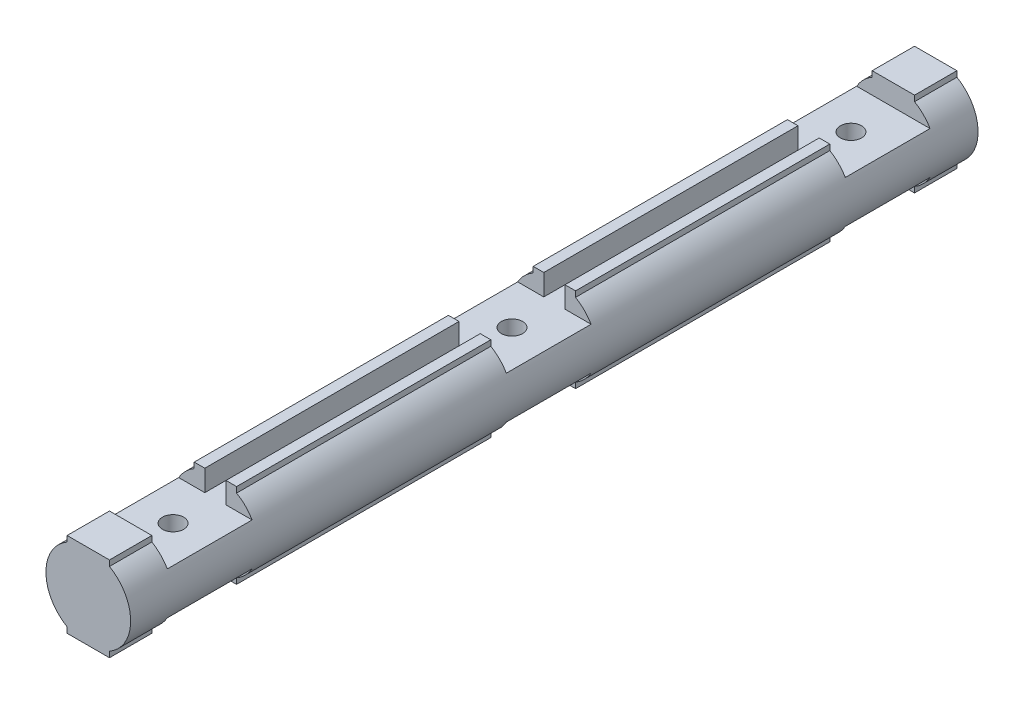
ISO-10303-21;
HEADER;
FILE_DESCRIPTION(('STEP AP214'),'2;1');
FILE_NAME('part.step','',(''),(''),'','','');
FILE_SCHEMA(('AUTOMOTIVE_DESIGN { 1 0 10303 214 1 1 1 1 }'));
ENDSEC;
DATA;
#1=APPLICATION_CONTEXT('core data for automotive mechanical design processes');
#2=APPLICATION_PROTOCOL_DEFINITION('international standard','automotive_design',2000,#1);
#3=PRODUCT_CONTEXT('',#1,'mechanical');
#4=PRODUCT('Part','Part','',(#3));
#5=PRODUCT_RELATED_PRODUCT_CATEGORY('part','',(#4));
#6=PRODUCT_DEFINITION_FORMATION('','',#4);
#7=PRODUCT_DEFINITION_CONTEXT('part definition',#1,'design');
#8=PRODUCT_DEFINITION('design','',#6,#7);
#9=PRODUCT_DEFINITION_SHAPE('','',#8);
#10=(LENGTH_UNIT() NAMED_UNIT(*) SI_UNIT(.MILLI.,.METRE.));
#11=(NAMED_UNIT(*) PLANE_ANGLE_UNIT() SI_UNIT($,.RADIAN.));
#12=(NAMED_UNIT(*) SI_UNIT($,.STERADIAN.) SOLID_ANGLE_UNIT());
#13=UNCERTAINTY_MEASURE_WITH_UNIT(LENGTH_MEASURE(1.E-05),#10,'distance_accuracy_value','');
#14=(GEOMETRIC_REPRESENTATION_CONTEXT(3) GLOBAL_UNCERTAINTY_ASSIGNED_CONTEXT((#13)) GLOBAL_UNIT_ASSIGNED_CONTEXT((#10,
#11,#12)) REPRESENTATION_CONTEXT('',''));
#15=CARTESIAN_POINT('',(0.,0.,0.));
#16=DIRECTION('',(0.,0.,1.));
#17=DIRECTION('',(1.,0.,0.));
#18=AXIS2_PLACEMENT_3D('',#15,#16,#17);
#19=CARTESIAN_POINT('',(0.,0.,100.));
#20=DIRECTION('',(0.,0.,-1.));
#21=DIRECTION('',(-1.,0.,0.));
#22=AXIS2_PLACEMENT_3D('',#19,#20,#21);
#23=CYLINDRICAL_SURFACE('',#22,10.);
#24=CARTESIAN_POINT('',(0.,0.,-90.));
#25=DIRECTION('',(0.,0.,-1.));
#26=DIRECTION('',(1.,0.,0.));
#27=AXIS2_PLACEMENT_3D('',#24,#25,#26);
#28=CIRCLE('',#27,10.);
#29=CARTESIAN_POINT('',(-5.,-8.66025403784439,-90.));
#30=VERTEX_POINT('',#29);
#31=CARTESIAN_POINT('',(-8.66025403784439,-5.,-90.));
#32=VERTEX_POINT('',#31);
#33=EDGE_CURVE('E563',#30,#32,#28,.T.);
#34=ORIENTED_EDGE('',*,*,#33,.T.);
#35=DIRECTION('',(0.,0.,1.));
#36=VECTOR('',#35,1.);
#37=CARTESIAN_POINT('',(-8.66025403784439,-5.,-90.));
#38=LINE('',#37,#36);
#39=CARTESIAN_POINT('',(-8.66025403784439,-5.,-70.));
#40=VERTEX_POINT('',#39);
#41=EDGE_CURVE('E484',#32,#40,#38,.T.);
#42=ORIENTED_EDGE('',*,*,#41,.T.);
#43=CARTESIAN_POINT('',(0.,0.,-70.));
#44=DIRECTION('',(0.,0.,-1.));
#45=DIRECTION('',(1.,0.,0.));
#46=AXIS2_PLACEMENT_3D('',#43,#44,#45);
#47=CIRCLE('',#46,10.);
#48=CARTESIAN_POINT('',(-5.,-8.66025403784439,-70.));
#49=VERTEX_POINT('',#48);
#50=EDGE_CURVE('E876',#49,#40,#47,.T.);
#51=ORIENTED_EDGE('',*,*,#50,.F.);
#52=DIRECTION('',(0.,0.,-1.));
#53=VECTOR('',#52,1.);
#54=CARTESIAN_POINT('',(-5.,-8.66025403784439,100.));
#55=LINE('',#54,#53);
#56=CARTESIAN_POINT('',(-5.,-8.66025403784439,-9.99999999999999));
#57=VERTEX_POINT('',#56);
#58=EDGE_CURVE('E780',#49,#57,#55,.F.);
#59=ORIENTED_EDGE('',*,*,#58,.T.);
#60=CARTESIAN_POINT('',(0.,0.,-9.99999999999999));
#61=DIRECTION('',(0.,0.,-1.));
#62=DIRECTION('',(1.,0.,0.));
#63=AXIS2_PLACEMENT_3D('',#60,#61,#62);
#64=CIRCLE('',#63,10.);
#65=CARTESIAN_POINT('',(-8.66025403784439,-5.,-10.));
#66=VERTEX_POINT('',#65);
#67=EDGE_CURVE('E47',#57,#66,#64,.T.);
#68=ORIENTED_EDGE('',*,*,#67,.T.);
#69=DIRECTION('',(0.,0.,1.));
#70=VECTOR('',#69,1.);
#71=CARTESIAN_POINT('',(-8.66025403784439,-5.,-10.));
#72=LINE('',#71,#70);
#73=CARTESIAN_POINT('',(-8.66025403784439,-5.,10.));
#74=VERTEX_POINT('',#73);
#75=EDGE_CURVE('E477',#66,#74,#72,.T.);
#76=ORIENTED_EDGE('',*,*,#75,.T.);
#77=CARTESIAN_POINT('',(0.,0.,9.99999999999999));
#78=DIRECTION('',(0.,0.,-1.));
#79=DIRECTION('',(1.,0.,0.));
#80=AXIS2_PLACEMENT_3D('',#77,#78,#79);
#81=CIRCLE('',#80,10.);
#82=CARTESIAN_POINT('',(-5.,-8.66025403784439,10.));
#83=VERTEX_POINT('',#82);
#84=EDGE_CURVE('E898',#83,#74,#81,.T.);
#85=ORIENTED_EDGE('',*,*,#84,.F.);
#86=CARTESIAN_POINT('',(-5.,-8.66025403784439,70.));
#87=VERTEX_POINT('',#86);
#88=EDGE_CURVE('E1563',#83,#87,#55,.F.);
#89=ORIENTED_EDGE('',*,*,#88,.T.);
#90=CARTESIAN_POINT('',(0.,0.,70.));
#91=DIRECTION('',(0.,0.,-1.));
#92=DIRECTION('',(1.,0.,0.));
#93=AXIS2_PLACEMENT_3D('',#90,#91,#92);
#94=CIRCLE('',#93,10.);
#95=CARTESIAN_POINT('',(-8.66025403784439,-5.,70.));
#96=VERTEX_POINT('',#95);
#97=EDGE_CURVE('E885',#87,#96,#94,.T.);
#98=ORIENTED_EDGE('',*,*,#97,.T.);
#99=DIRECTION('',(0.,0.,1.));
#100=VECTOR('',#99,1.);
#101=CARTESIAN_POINT('',(-8.66025403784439,-5.,70.));
#102=LINE('',#101,#100);
#103=CARTESIAN_POINT('',(-8.66025403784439,-5.,90.));
#104=VERTEX_POINT('',#103);
#105=EDGE_CURVE('E470',#96,#104,#102,.T.);
#106=ORIENTED_EDGE('',*,*,#105,.T.);
#107=CARTESIAN_POINT('',(0.,0.,90.));
#108=DIRECTION('',(0.,0.,-1.));
#109=DIRECTION('',(1.,0.,0.));
#110=AXIS2_PLACEMENT_3D('',#107,#108,#109);
#111=CIRCLE('',#110,10.);
#112=CARTESIAN_POINT('',(-5.,-8.66025403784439,90.));
#113=VERTEX_POINT('',#112);
#114=EDGE_CURVE('E555',#113,#104,#111,.T.);
#115=ORIENTED_EDGE('',*,*,#114,.F.);
#116=CARTESIAN_POINT('',(-5.,-8.66025403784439,100.));
#117=VERTEX_POINT('',#116);
#118=EDGE_CURVE('E775',#113,#117,#55,.F.);
#119=ORIENTED_EDGE('',*,*,#118,.T.);
#120=CARTESIAN_POINT('',(0.,0.,100.));
#121=DIRECTION('',(0.,0.,1.));
#122=DIRECTION('',(1.,0.,0.));
#123=AXIS2_PLACEMENT_3D('',#120,#121,#122);
#124=CIRCLE('',#123,10.);
#125=CARTESIAN_POINT('',(-5.,8.66025403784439,100.));
#126=VERTEX_POINT('',#125);
#127=EDGE_CURVE('E789',#126,#117,#124,.T.);
#128=ORIENTED_EDGE('',*,*,#127,.F.);
#129=DIRECTION('',(0.,0.,-1.));
#130=VECTOR('',#129,1.);
#131=CARTESIAN_POINT('',(-5.,8.66025403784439,100.));
#132=LINE('',#131,#130);
#133=CARTESIAN_POINT('',(-5.,8.66025403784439,90.));
#134=VERTEX_POINT('',#133);
#135=EDGE_CURVE('E781',#126,#134,#132,.T.);
#136=ORIENTED_EDGE('',*,*,#135,.T.);
#137=CARTESIAN_POINT('',(0.,0.,90.));
#138=DIRECTION('',(0.,0.,1.));
#139=DIRECTION('',(1.,0.,0.));
#140=AXIS2_PLACEMENT_3D('',#137,#138,#139);
#141=CIRCLE('',#140,10.);
#142=CARTESIAN_POINT('',(-8.66025403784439,5.,90.));
#143=VERTEX_POINT('',#142);
#144=EDGE_CURVE('E614',#134,#143,#141,.T.);
#145=ORIENTED_EDGE('',*,*,#144,.T.);
#146=DIRECTION('',(0.,0.,1.));
#147=VECTOR('',#146,1.);
#148=CARTESIAN_POINT('',(-8.66025403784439,5.,70.));
#149=LINE('',#148,#147);
#150=CARTESIAN_POINT('',(-8.66025403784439,5.,70.));
#151=VERTEX_POINT('',#150);
#152=EDGE_CURVE('E598',#151,#143,#149,.T.);
#153=ORIENTED_EDGE('',*,*,#152,.F.);
#154=CARTESIAN_POINT('',(0.,0.,70.));
#155=DIRECTION('',(0.,0.,1.));
#156=DIRECTION('',(1.,0.,0.));
#157=AXIS2_PLACEMENT_3D('',#154,#155,#156);
#158=CIRCLE('',#157,10.);
#159=CARTESIAN_POINT('',(-5.,8.66025403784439,70.));
#160=VERTEX_POINT('',#159);
#161=EDGE_CURVE('E607',#160,#151,#158,.T.);
#162=ORIENTED_EDGE('',*,*,#161,.F.);
#163=CARTESIAN_POINT('',(-5.,8.66025403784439,10.));
#164=VERTEX_POINT('',#163);
#165=EDGE_CURVE('E785',#160,#164,#132,.T.);
#166=ORIENTED_EDGE('',*,*,#165,.T.);
#167=CARTESIAN_POINT('',(0.,0.,9.99999999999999));
#168=DIRECTION('',(0.,0.,1.));
#169=DIRECTION('',(1.,0.,0.));
#170=AXIS2_PLACEMENT_3D('',#167,#168,#169);
#171=CIRCLE('',#170,10.);
#172=CARTESIAN_POINT('',(-8.66025403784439,5.,10.));
#173=VERTEX_POINT('',#172);
#174=EDGE_CURVE('E644',#164,#173,#171,.T.);
#175=ORIENTED_EDGE('',*,*,#174,.T.);
#176=DIRECTION('',(0.,0.,1.));
#177=VECTOR('',#176,1.);
#178=CARTESIAN_POINT('',(-8.66025403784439,5.,-10.));
#179=LINE('',#178,#177);
#180=CARTESIAN_POINT('',(-8.66025403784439,5.,-10.));
#181=VERTEX_POINT('',#180);
#182=EDGE_CURVE('E634',#181,#173,#179,.T.);
#183=ORIENTED_EDGE('',*,*,#182,.F.);
#184=CARTESIAN_POINT('',(0.,0.,-9.99999999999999));
#185=DIRECTION('',(0.,0.,1.));
#186=DIRECTION('',(1.,0.,0.));
#187=AXIS2_PLACEMENT_3D('',#184,#185,#186);
#188=CIRCLE('',#187,10.);
#189=CARTESIAN_POINT('',(-5.,8.66025403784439,-9.99999999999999));
#190=VERTEX_POINT('',#189);
#191=EDGE_CURVE('E657',#190,#181,#188,.T.);
#192=ORIENTED_EDGE('',*,*,#191,.F.);
#193=CARTESIAN_POINT('',(-5.,8.66025403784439,-70.));
#194=VERTEX_POINT('',#193);
#195=EDGE_CURVE('E826',#190,#194,#132,.T.);
#196=ORIENTED_EDGE('',*,*,#195,.T.);
#197=CARTESIAN_POINT('',(0.,0.,-70.));
#198=DIRECTION('',(0.,0.,1.));
#199=DIRECTION('',(1.,0.,0.));
#200=AXIS2_PLACEMENT_3D('',#197,#198,#199);
#201=CIRCLE('',#200,10.);
#202=CARTESIAN_POINT('',(-8.66025403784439,5.,-70.));
#203=VERTEX_POINT('',#202);
#204=EDGE_CURVE('E712',#194,#203,#201,.T.);
#205=ORIENTED_EDGE('',*,*,#204,.T.);
#206=DIRECTION('',(0.,0.,1.));
#207=VECTOR('',#206,1.);
#208=CARTESIAN_POINT('',(-8.66025403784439,5.,-90.));
#209=LINE('',#208,#207);
#210=CARTESIAN_POINT('',(-8.66025403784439,5.,-90.));
#211=VERTEX_POINT('',#210);
#212=EDGE_CURVE('E695',#211,#203,#209,.T.);
#213=ORIENTED_EDGE('',*,*,#212,.F.);
#214=CARTESIAN_POINT('',(0.,0.,-90.));
#215=DIRECTION('',(0.,0.,1.));
#216=DIRECTION('',(1.,0.,0.));
#217=AXIS2_PLACEMENT_3D('',#214,#215,#216);
#218=CIRCLE('',#217,10.);
#219=CARTESIAN_POINT('',(-5.,8.66025403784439,-90.));
#220=VERTEX_POINT('',#219);
#221=EDGE_CURVE('E720',#220,#211,#218,.T.);
#222=ORIENTED_EDGE('',*,*,#221,.F.);
#223=CARTESIAN_POINT('',(-5.,8.66025403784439,-100.));
#224=VERTEX_POINT('',#223);
#225=EDGE_CURVE('E779',#220,#224,#132,.T.);
#226=ORIENTED_EDGE('',*,*,#225,.T.);
#227=CARTESIAN_POINT('',(0.,0.,-100.));
#228=DIRECTION('',(0.,0.,1.));
#229=DIRECTION('',(1.,0.,0.));
#230=AXIS2_PLACEMENT_3D('',#227,#228,#229);
#231=CIRCLE('',#230,10.);
#232=CARTESIAN_POINT('',(-5.,-8.66025403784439,-100.));
#233=VERTEX_POINT('',#232);
#234=EDGE_CURVE('E790',#224,#233,#231,.T.);
#235=ORIENTED_EDGE('',*,*,#234,.T.);
#236=EDGE_CURVE('E776',#233,#30,#55,.F.);
#237=ORIENTED_EDGE('',*,*,#236,.T.);
#238=EDGE_LOOP('',(#34,#42,#51,#59,#68,#76,#85,#89,#98,#106,#115,#119,#128,#136,#145,#153,#162,
#166,#175,#183,#192,#196,#205,#213,#222,#226,#235,#237));
#239=FACE_BOUND('',#238,.T.);
#240=ADVANCED_FACE('F33',(#239),#23,.T.);
#241=DIRECTION('',(0.,0.,-1.));
#242=VECTOR('',#241,1.);
#243=CARTESIAN_POINT('',(5.,-8.66025403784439,100.));
#244=LINE('',#243,#242);
#245=CARTESIAN_POINT('',(5.,-8.66025403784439,100.));
#246=VERTEX_POINT('',#245);
#247=CARTESIAN_POINT('',(5.,-8.66025403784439,90.));
#248=VERTEX_POINT('',#247);
#249=EDGE_CURVE('E773',#246,#248,#244,.T.);
#250=ORIENTED_EDGE('',*,*,#249,.T.);
#251=CARTESIAN_POINT('',(0.,0.,90.));
#252=DIRECTION('',(0.,0.,-1.));
#253=DIRECTION('',(1.,0.,0.));
#254=AXIS2_PLACEMENT_3D('',#251,#252,#253);
#255=CIRCLE('',#254,10.);
#256=CARTESIAN_POINT('',(8.66025403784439,-5.,90.));
#257=VERTEX_POINT('',#256);
#258=EDGE_CURVE('E553',#257,#248,#255,.T.);
#259=ORIENTED_EDGE('',*,*,#258,.F.);
#260=DIRECTION('',(0.,0.,1.));
#261=VECTOR('',#260,1.);
#262=CARTESIAN_POINT('',(8.66025403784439,-5.,70.));
#263=LINE('',#262,#261);
#264=CARTESIAN_POINT('',(8.66025403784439,-5.,70.));
#265=VERTEX_POINT('',#264);
#266=EDGE_CURVE('E465',#265,#257,#263,.T.);
#267=ORIENTED_EDGE('',*,*,#266,.F.);
#268=CARTESIAN_POINT('',(0.,0.,70.));
#269=DIRECTION('',(0.,0.,-1.));
#270=DIRECTION('',(1.,0.,0.));
#271=AXIS2_PLACEMENT_3D('',#268,#269,#270);
#272=CIRCLE('',#271,10.);
#273=CARTESIAN_POINT('',(5.,-8.66025403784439,70.));
#274=VERTEX_POINT('',#273);
#275=EDGE_CURVE('E902',#265,#274,#272,.T.);
#276=ORIENTED_EDGE('',*,*,#275,.T.);
#277=CARTESIAN_POINT('',(5.,-8.66025403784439,10.));
#278=VERTEX_POINT('',#277);
#279=EDGE_CURVE('E538',#274,#278,#244,.T.);
#280=ORIENTED_EDGE('',*,*,#279,.T.);
#281=CARTESIAN_POINT('',(0.,0.,9.99999999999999));
#282=DIRECTION('',(0.,0.,-1.));
#283=DIRECTION('',(1.,0.,0.));
#284=AXIS2_PLACEMENT_3D('',#281,#282,#283);
#285=CIRCLE('',#284,10.);
#286=CARTESIAN_POINT('',(8.66025403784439,-5.,10.));
#287=VERTEX_POINT('',#286);
#288=EDGE_CURVE('E533',#287,#278,#285,.T.);
#289=ORIENTED_EDGE('',*,*,#288,.F.);
#290=DIRECTION('',(0.,0.,1.));
#291=VECTOR('',#290,1.);
#292=CARTESIAN_POINT('',(8.66025403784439,-5.,-10.));
#293=LINE('',#292,#291);
#294=CARTESIAN_POINT('',(8.66025403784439,-5.,-10.));
#295=VERTEX_POINT('',#294);
#296=EDGE_CURVE('E495',#295,#287,#293,.T.);
#297=ORIENTED_EDGE('',*,*,#296,.F.);
#298=CARTESIAN_POINT('',(0.,0.,-9.99999999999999));
#299=DIRECTION('',(0.,0.,-1.));
#300=DIRECTION('',(1.,0.,0.));
#301=AXIS2_PLACEMENT_3D('',#298,#299,#300);
#302=CIRCLE('',#301,10.);
#303=CARTESIAN_POINT('',(5.,-8.66025403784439,-9.99999999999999));
#304=VERTEX_POINT('',#303);
#305=EDGE_CURVE('E439',#295,#304,#302,.T.);
#306=ORIENTED_EDGE('',*,*,#305,.T.);
#307=CARTESIAN_POINT('',(5.,-8.66025403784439,-70.));
#308=VERTEX_POINT('',#307);
#309=EDGE_CURVE('E916',#304,#308,#244,.T.);
#310=ORIENTED_EDGE('',*,*,#309,.T.);
#311=CARTESIAN_POINT('',(0.,0.,-70.));
#312=DIRECTION('',(0.,0.,-1.));
#313=DIRECTION('',(1.,0.,0.));
#314=AXIS2_PLACEMENT_3D('',#311,#312,#313);
#315=CIRCLE('',#314,10.);
#316=CARTESIAN_POINT('',(8.66025403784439,-5.,-70.));
#317=VERTEX_POINT('',#316);
#318=EDGE_CURVE('E561',#317,#308,#315,.T.);
#319=ORIENTED_EDGE('',*,*,#318,.F.);
#320=DIRECTION('',(0.,0.,1.));
#321=VECTOR('',#320,1.);
#322=CARTESIAN_POINT('',(8.66025403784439,-5.,-90.));
#323=LINE('',#322,#321);
#324=CARTESIAN_POINT('',(8.66025403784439,-5.,-90.));
#325=VERTEX_POINT('',#324);
#326=EDGE_CURVE('E489',#325,#317,#323,.T.);
#327=ORIENTED_EDGE('',*,*,#326,.F.);
#328=CARTESIAN_POINT('',(0.,0.,-90.));
#329=DIRECTION('',(0.,0.,-1.));
#330=DIRECTION('',(1.,0.,0.));
#331=AXIS2_PLACEMENT_3D('',#328,#329,#330);
#332=CIRCLE('',#331,10.);
#333=CARTESIAN_POINT('',(5.,-8.66025403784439,-90.));
#334=VERTEX_POINT('',#333);
#335=EDGE_CURVE('E566',#325,#334,#332,.T.);
#336=ORIENTED_EDGE('',*,*,#335,.T.);
#337=CARTESIAN_POINT('',(5.,-8.66025403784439,-100.));
#338=VERTEX_POINT('',#337);
#339=EDGE_CURVE('E771',#334,#338,#244,.T.);
#340=ORIENTED_EDGE('',*,*,#339,.T.);
#341=CARTESIAN_POINT('',(5.,8.66025403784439,-100.));
#342=VERTEX_POINT('',#341);
#343=EDGE_CURVE('E784',#338,#342,#231,.T.);
#344=ORIENTED_EDGE('',*,*,#343,.T.);
#345=DIRECTION('',(0.,0.,-1.));
#346=VECTOR('',#345,1.);
#347=CARTESIAN_POINT('',(5.,8.66025403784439,100.));
#348=LINE('',#347,#346);
#349=CARTESIAN_POINT('',(5.,8.66025403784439,-90.));
#350=VERTEX_POINT('',#349);
#351=EDGE_CURVE('E768',#342,#350,#348,.F.);
#352=ORIENTED_EDGE('',*,*,#351,.T.);
#353=CARTESIAN_POINT('',(0.,0.,-90.));
#354=DIRECTION('',(0.,0.,1.));
#355=DIRECTION('',(1.,0.,0.));
#356=AXIS2_PLACEMENT_3D('',#353,#354,#355);
#357=CIRCLE('',#356,10.);
#358=CARTESIAN_POINT('',(8.66025403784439,5.,-90.));
#359=VERTEX_POINT('',#358);
#360=EDGE_CURVE('E715',#359,#350,#357,.T.);
#361=ORIENTED_EDGE('',*,*,#360,.F.);
#362=DIRECTION('',(0.,0.,1.));
#363=VECTOR('',#362,1.);
#364=CARTESIAN_POINT('',(8.66025403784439,5.,-90.));
#365=LINE('',#364,#363);
#366=CARTESIAN_POINT('',(8.66025403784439,5.,-70.));
#367=VERTEX_POINT('',#366);
#368=EDGE_CURVE('E702',#359,#367,#365,.T.);
#369=ORIENTED_EDGE('',*,*,#368,.T.);
#370=CARTESIAN_POINT('',(0.,0.,-70.));
#371=DIRECTION('',(0.,0.,1.));
#372=DIRECTION('',(1.,0.,0.));
#373=AXIS2_PLACEMENT_3D('',#370,#371,#372);
#374=CIRCLE('',#373,10.);
#375=CARTESIAN_POINT('',(5.,8.66025403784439,-70.));
#376=VERTEX_POINT('',#375);
#377=EDGE_CURVE('E705',#367,#376,#374,.T.);
#378=ORIENTED_EDGE('',*,*,#377,.T.);
#379=CARTESIAN_POINT('',(5.,8.66025403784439,-9.99999999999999));
#380=VERTEX_POINT('',#379);
#381=EDGE_CURVE('E772',#376,#380,#348,.F.);
#382=ORIENTED_EDGE('',*,*,#381,.T.);
#383=CARTESIAN_POINT('',(0.,0.,-9.99999999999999));
#384=DIRECTION('',(0.,0.,1.));
#385=DIRECTION('',(1.,0.,0.));
#386=AXIS2_PLACEMENT_3D('',#383,#384,#385);
#387=CIRCLE('',#386,10.);
#388=CARTESIAN_POINT('',(8.66025403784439,5.,-10.));
#389=VERTEX_POINT('',#388);
#390=EDGE_CURVE('E652',#389,#380,#387,.T.);
#391=ORIENTED_EDGE('',*,*,#390,.F.);
#392=DIRECTION('',(0.,0.,1.));
#393=VECTOR('',#392,1.);
#394=CARTESIAN_POINT('',(8.66025403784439,5.,-10.));
#395=LINE('',#394,#393);
#396=CARTESIAN_POINT('',(8.66025403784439,5.,10.));
#397=VERTEX_POINT('',#396);
#398=EDGE_CURVE('E630',#389,#397,#395,.T.);
#399=ORIENTED_EDGE('',*,*,#398,.T.);
#400=CARTESIAN_POINT('',(0.,0.,9.99999999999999));
#401=DIRECTION('',(0.,0.,1.));
#402=DIRECTION('',(1.,0.,0.));
#403=AXIS2_PLACEMENT_3D('',#400,#401,#402);
#404=CIRCLE('',#403,10.);
#405=CARTESIAN_POINT('',(5.,8.66025403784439,10.));
#406=VERTEX_POINT('',#405);
#407=EDGE_CURVE('E639',#397,#406,#404,.T.);
#408=ORIENTED_EDGE('',*,*,#407,.T.);
#409=CARTESIAN_POINT('',(5.,8.66025403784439,70.));
#410=VERTEX_POINT('',#409);
#411=EDGE_CURVE('E1042',#406,#410,#348,.F.);
#412=ORIENTED_EDGE('',*,*,#411,.T.);
#413=CARTESIAN_POINT('',(0.,0.,70.));
#414=DIRECTION('',(0.,0.,1.));
#415=DIRECTION('',(1.,0.,0.));
#416=AXIS2_PLACEMENT_3D('',#413,#414,#415);
#417=CIRCLE('',#416,10.);
#418=CARTESIAN_POINT('',(8.66025403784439,5.,70.));
#419=VERTEX_POINT('',#418);
#420=EDGE_CURVE('E602',#419,#410,#417,.T.);
#421=ORIENTED_EDGE('',*,*,#420,.F.);
#422=DIRECTION('',(0.,0.,1.));
#423=VECTOR('',#422,1.);
#424=CARTESIAN_POINT('',(8.66025403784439,5.,70.));
#425=LINE('',#424,#423);
#426=CARTESIAN_POINT('',(8.66025403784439,5.,90.));
#427=VERTEX_POINT('',#426);
#428=EDGE_CURVE('E594',#419,#427,#425,.T.);
#429=ORIENTED_EDGE('',*,*,#428,.T.);
#430=CARTESIAN_POINT('',(0.,0.,90.));
#431=DIRECTION('',(0.,0.,1.));
#432=DIRECTION('',(1.,0.,0.));
#433=AXIS2_PLACEMENT_3D('',#430,#431,#432);
#434=CIRCLE('',#433,10.);
#435=CARTESIAN_POINT('',(5.,8.66025403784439,90.));
#436=VERTEX_POINT('',#435);
#437=EDGE_CURVE('E609',#427,#436,#434,.T.);
#438=ORIENTED_EDGE('',*,*,#437,.T.);
#439=CARTESIAN_POINT('',(5.,8.66025403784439,100.));
#440=VERTEX_POINT('',#439);
#441=EDGE_CURVE('E767',#436,#440,#348,.F.);
#442=ORIENTED_EDGE('',*,*,#441,.T.);
#443=EDGE_CURVE('E786',#246,#440,#124,.T.);
#444=ORIENTED_EDGE('',*,*,#443,.F.);
#445=EDGE_LOOP('',(#250,#259,#267,#276,#280,#289,#297,#306,#310,#319,#327,#336,#340,#344,#352,
#361,#369,#378,#382,#391,#399,#408,#412,#421,#429,#438,#442,#444));
#446=FACE_BOUND('',#445,.T.);
#447=ADVANCED_FACE('F535',(#446),#23,.T.);
#448=CARTESIAN_POINT('',(5.,-10.,-122.360679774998));
#449=DIRECTION('',(1.,0.,0.));
#450=DIRECTION('',(0.,0.,-1.));
#451=AXIS2_PLACEMENT_3D('',#448,#449,#450);
#452=PLANE('',#451);
#453=ORIENTED_EDGE('',*,*,#339,.F.);
#454=DIRECTION('',(0.,1.,0.));
#455=VECTOR('',#454,1.);
#456=CARTESIAN_POINT('',(5.,10.,-90.));
#457=LINE('',#456,#455);
#458=CARTESIAN_POINT('',(5.,-10.,-90.));
#459=VERTEX_POINT('',#458);
#460=EDGE_CURVE('E569',#459,#334,#457,.T.);
#461=ORIENTED_EDGE('',*,*,#460,.F.);
#462=DIRECTION('',(0.,0.,1.));
#463=VECTOR('',#462,1.);
#464=CARTESIAN_POINT('',(5.,-10.,-122.360679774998));
#465=LINE('',#464,#463);
#466=CARTESIAN_POINT('',(5.,-10.,-100.));
#467=VERTEX_POINT('',#466);
#468=EDGE_CURVE('E758',#467,#459,#465,.T.);
#469=ORIENTED_EDGE('',*,*,#468,.F.);
#470=DIRECTION('',(0.,-1.,0.));
#471=VECTOR('',#470,1.);
#472=CARTESIAN_POINT('',(5.,-10.,-100.));
#473=LINE('',#472,#471);
#474=EDGE_CURVE('E727',#338,#467,#473,.T.);
#475=ORIENTED_EDGE('',*,*,#474,.F.);
#476=EDGE_LOOP('',(#453,#461,#469,#475));
#477=FACE_BOUND('',#476,.T.);
#478=ADVANCED_FACE('F933',(#477),#452,.T.);
#479=DIRECTION('',(0.,1.,0.));
#480=VECTOR('',#479,1.);
#481=CARTESIAN_POINT('',(5.,10.,-70.));
#482=LINE('',#481,#480);
#483=CARTESIAN_POINT('',(5.,-10.,-70.));
#484=VERTEX_POINT('',#483);
#485=EDGE_CURVE('E436',#484,#308,#482,.T.);
#486=ORIENTED_EDGE('',*,*,#485,.T.);
#487=ORIENTED_EDGE('',*,*,#309,.F.);
#488=DIRECTION('',(0.,1.,0.));
#489=VECTOR('',#488,1.);
#490=CARTESIAN_POINT('',(5.,10.,-9.99999999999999));
#491=LINE('',#490,#489);
#492=CARTESIAN_POINT('',(5.,-10.,-10.));
#493=VERTEX_POINT('',#492);
#494=EDGE_CURVE('E433',#493,#304,#491,.T.);
#495=ORIENTED_EDGE('',*,*,#494,.F.);
#496=EDGE_CURVE('E431',#484,#493,#465,.T.);
#497=ORIENTED_EDGE('',*,*,#496,.F.);
#498=EDGE_LOOP('',(#486,#487,#495,#497));
#499=FACE_BOUND('',#498,.T.);
#500=ADVANCED_FACE('F977',(#499),#452,.T.);
#501=DIRECTION('',(0.,1.,0.));
#502=VECTOR('',#501,1.);
#503=CARTESIAN_POINT('',(5.,10.,10.));
#504=LINE('',#503,#502);
#505=CARTESIAN_POINT('',(5.,-10.,10.));
#506=VERTEX_POINT('',#505);
#507=EDGE_CURVE('E541',#506,#278,#504,.T.);
#508=ORIENTED_EDGE('',*,*,#507,.T.);
#509=ORIENTED_EDGE('',*,*,#279,.F.);
#510=DIRECTION('',(0.,1.,0.));
#511=VECTOR('',#510,1.);
#512=CARTESIAN_POINT('',(5.,10.,70.));
#513=LINE('',#512,#511);
#514=CARTESIAN_POINT('',(5.,-10.,70.));
#515=VERTEX_POINT('',#514);
#516=EDGE_CURVE('E903',#515,#274,#513,.T.);
#517=ORIENTED_EDGE('',*,*,#516,.F.);
#518=EDGE_CURVE('E912',#506,#515,#465,.T.);
#519=ORIENTED_EDGE('',*,*,#518,.F.);
#520=EDGE_LOOP('',(#508,#509,#517,#519));
#521=FACE_BOUND('',#520,.T.);
#522=ADVANCED_FACE('F915',(#521),#452,.T.);
#523=CARTESIAN_POINT('',(5.,-10.,-122.360679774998));
#524=DIRECTION('',(0.,-1.,0.));
#525=DIRECTION('',(0.,0.,-1.));
#526=AXIS2_PLACEMENT_3D('',#523,#524,#525);
#527=PLANE('',#526);
#528=ORIENTED_EDGE('',*,*,#468,.T.);
#529=DIRECTION('',(-1.,0.,0.));
#530=VECTOR('',#529,1.);
#531=CARTESIAN_POINT('',(8.66025403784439,-10.,-90.));
#532=LINE('',#531,#530);
#533=CARTESIAN_POINT('',(-5.,-10.,-90.));
#534=VERTEX_POINT('',#533);
#535=EDGE_CURVE('E571',#459,#534,#532,.T.);
#536=ORIENTED_EDGE('',*,*,#535,.T.);
#537=DIRECTION('',(0.,0.,1.));
#538=VECTOR('',#537,1.);
#539=CARTESIAN_POINT('',(-5.,-10.,-122.360679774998));
#540=LINE('',#539,#538);
#541=CARTESIAN_POINT('',(-5.,-10.,-100.));
#542=VERTEX_POINT('',#541);
#543=EDGE_CURVE('E762',#542,#534,#540,.T.);
#544=ORIENTED_EDGE('',*,*,#543,.F.);
#545=DIRECTION('',(-1.,0.,0.));
#546=VECTOR('',#545,1.);
#547=CARTESIAN_POINT('',(5.,-10.,-100.));
#548=LINE('',#547,#546);
#549=EDGE_CURVE('E733',#467,#542,#548,.T.);
#550=ORIENTED_EDGE('',*,*,#549,.F.);
#551=EDGE_LOOP('',(#528,#536,#544,#550));
#552=FACE_BOUND('',#551,.T.);
#553=ADVANCED_FACE('F935',(#552),#527,.T.);
#554=DIRECTION('',(-1.,0.,0.));
#555=VECTOR('',#554,1.);
#556=CARTESIAN_POINT('',(8.66025403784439,-10.,90.));
#557=LINE('',#556,#555);
#558=CARTESIAN_POINT('',(5.,-10.,90.));
#559=VERTEX_POINT('',#558);
#560=CARTESIAN_POINT('',(-5.,-10.,90.));
#561=VERTEX_POINT('',#560);
#562=EDGE_CURVE('E544',#559,#561,#557,.T.);
#563=ORIENTED_EDGE('',*,*,#562,.F.);
#564=CARTESIAN_POINT('',(5.,-10.,100.));
#565=VERTEX_POINT('',#564);
#566=EDGE_CURVE('E761',#559,#565,#465,.T.);
#567=ORIENTED_EDGE('',*,*,#566,.T.);
#568=DIRECTION('',(1.,0.,0.));
#569=VECTOR('',#568,1.);
#570=CARTESIAN_POINT('',(5.,-10.,100.));
#571=LINE('',#570,#569);
#572=CARTESIAN_POINT('',(-5.,-10.,100.));
#573=VERTEX_POINT('',#572);
#574=EDGE_CURVE('E737',#573,#565,#571,.T.);
#575=ORIENTED_EDGE('',*,*,#574,.F.);
#576=EDGE_CURVE('E747',#561,#573,#540,.T.);
#577=ORIENTED_EDGE('',*,*,#576,.F.);
#578=EDGE_LOOP('',(#563,#567,#575,#577));
#579=FACE_BOUND('',#578,.T.);
#580=ADVANCED_FACE('F1086',(#579),#527,.T.);
#581=DIRECTION('',(-1.,0.,0.));
#582=VECTOR('',#581,1.);
#583=CARTESIAN_POINT('',(8.66025403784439,-10.,10.));
#584=LINE('',#583,#582);
#585=CARTESIAN_POINT('',(2.5,-10.,10.));
#586=VERTEX_POINT('',#585);
#587=EDGE_CURVE('E523',#506,#586,#584,.T.);
#588=ORIENTED_EDGE('',*,*,#587,.F.);
#589=ORIENTED_EDGE('',*,*,#518,.T.);
#590=DIRECTION('',(-1.,0.,0.));
#591=VECTOR('',#590,1.);
#592=CARTESIAN_POINT('',(8.66025403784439,-10.,70.));
#593=LINE('',#592,#591);
#594=CARTESIAN_POINT('',(2.5,-10.,70.));
#595=VERTEX_POINT('',#594);
#596=EDGE_CURVE('E892',#515,#595,#593,.T.);
#597=ORIENTED_EDGE('',*,*,#596,.T.);
#598=DIRECTION('',(0.,0.,-1.));
#599=VECTOR('',#598,1.);
#600=CARTESIAN_POINT('',(2.5,-10.,70.));
#601=LINE('',#600,#599);
#602=EDGE_CURVE('E427',#595,#586,#601,.T.);
#603=ORIENTED_EDGE('',*,*,#602,.T.);
#604=EDGE_LOOP('',(#588,#589,#597,#603));
#605=FACE_BOUND('',#604,.T.);
#606=ADVANCED_FACE('F910',(#605),#527,.T.);
#607=CARTESIAN_POINT('',(-2.5,-10.,10.));
#608=VERTEX_POINT('',#607);
#609=CARTESIAN_POINT('',(-5.,-10.,10.));
#610=VERTEX_POINT('',#609);
#611=EDGE_CURVE('E896',#608,#610,#584,.T.);
#612=ORIENTED_EDGE('',*,*,#611,.F.);
#613=DIRECTION('',(0.,0.,1.));
#614=VECTOR('',#613,1.);
#615=CARTESIAN_POINT('',(-2.5,-10.,70.));
#616=LINE('',#615,#614);
#617=CARTESIAN_POINT('',(-2.5,-10.,70.));
#618=VERTEX_POINT('',#617);
#619=EDGE_CURVE('E456',#608,#618,#616,.T.);
#620=ORIENTED_EDGE('',*,*,#619,.T.);
#621=CARTESIAN_POINT('',(-5.,-10.,70.));
#622=VERTEX_POINT('',#621);
#623=EDGE_CURVE('E888',#618,#622,#593,.T.);
#624=ORIENTED_EDGE('',*,*,#623,.T.);
#625=EDGE_CURVE('E861',#610,#622,#540,.T.);
#626=ORIENTED_EDGE('',*,*,#625,.F.);
#627=EDGE_LOOP('',(#612,#620,#624,#626));
#628=FACE_BOUND('',#627,.T.);
#629=ADVANCED_FACE('F1335',(#628),#527,.T.);
#630=DIRECTION('',(-1.,0.,0.));
#631=VECTOR('',#630,1.);
#632=CARTESIAN_POINT('',(8.66025403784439,-10.,-70.));
#633=LINE('',#632,#631);
#634=CARTESIAN_POINT('',(-2.5,-10.,-70.));
#635=VERTEX_POINT('',#634);
#636=CARTESIAN_POINT('',(-5.,-10.,-70.));
#637=VERTEX_POINT('',#636);
#638=EDGE_CURVE('E438',#635,#637,#633,.T.);
#639=ORIENTED_EDGE('',*,*,#638,.F.);
#640=CARTESIAN_POINT('',(-2.5,-10.,-10.));
#641=VERTEX_POINT('',#640);
#642=EDGE_CURVE('E450',#635,#641,#616,.T.);
#643=ORIENTED_EDGE('',*,*,#642,.T.);
#644=DIRECTION('',(-1.,0.,0.));
#645=VECTOR('',#644,1.);
#646=CARTESIAN_POINT('',(8.66025403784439,-10.,-10.));
#647=LINE('',#646,#645);
#648=CARTESIAN_POINT('',(-5.,-10.,-10.));
#649=VERTEX_POINT('',#648);
#650=EDGE_CURVE('E435',#641,#649,#647,.T.);
#651=ORIENTED_EDGE('',*,*,#650,.T.);
#652=EDGE_CURVE('E765',#637,#649,#540,.T.);
#653=ORIENTED_EDGE('',*,*,#652,.F.);
#654=EDGE_LOOP('',(#639,#643,#651,#653));
#655=FACE_BOUND('',#654,.T.);
#656=ADVANCED_FACE('F873',(#655),#527,.T.);
#657=CARTESIAN_POINT('',(-5.,-10.,-122.360679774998));
#658=DIRECTION('',(-1.,0.,0.));
#659=DIRECTION('',(0.,0.,1.));
#660=AXIS2_PLACEMENT_3D('',#657,#658,#659);
#661=PLANE('',#660);
#662=ORIENTED_EDGE('',*,*,#543,.T.);
#663=DIRECTION('',(0.,-1.,0.));
#664=VECTOR('',#663,1.);
#665=CARTESIAN_POINT('',(-5.,10.,-90.));
#666=LINE('',#665,#664);
#667=EDGE_CURVE('E574',#30,#534,#666,.T.);
#668=ORIENTED_EDGE('',*,*,#667,.F.);
#669=ORIENTED_EDGE('',*,*,#236,.F.);
#670=DIRECTION('',(0.,1.,0.));
#671=VECTOR('',#670,1.);
#672=CARTESIAN_POINT('',(-5.,-10.,-100.));
#673=LINE('',#672,#671);
#674=EDGE_CURVE('E730',#542,#233,#673,.T.);
#675=ORIENTED_EDGE('',*,*,#674,.F.);
#676=EDGE_LOOP('',(#662,#668,#669,#675));
#677=FACE_BOUND('',#676,.T.);
#678=ADVANCED_FACE('F941',(#677),#661,.T.);
#679=DIRECTION('',(0.,-1.,0.));
#680=VECTOR('',#679,1.);
#681=CARTESIAN_POINT('',(-5.,10.,10.));
#682=LINE('',#681,#680);
#683=EDGE_CURVE('E894',#83,#610,#682,.T.);
#684=ORIENTED_EDGE('',*,*,#683,.T.);
#685=ORIENTED_EDGE('',*,*,#625,.T.);
#686=DIRECTION('',(0.,-1.,0.));
#687=VECTOR('',#686,1.);
#688=CARTESIAN_POINT('',(-5.,10.,70.));
#689=LINE('',#688,#687);
#690=EDGE_CURVE('E891',#87,#622,#689,.T.);
#691=ORIENTED_EDGE('',*,*,#690,.F.);
#692=ORIENTED_EDGE('',*,*,#88,.F.);
#693=EDGE_LOOP('',(#684,#685,#691,#692));
#694=FACE_BOUND('',#693,.T.);
#695=ADVANCED_FACE('F1358',(#694),#661,.T.);
#696=DIRECTION('',(0.,-1.,0.));
#697=VECTOR('',#696,1.);
#698=CARTESIAN_POINT('',(-5.,10.,-70.));
#699=LINE('',#698,#697);
#700=EDGE_CURVE('E871',#49,#637,#699,.T.);
#701=ORIENTED_EDGE('',*,*,#700,.T.);
#702=ORIENTED_EDGE('',*,*,#652,.T.);
#703=DIRECTION('',(0.,-1.,0.));
#704=VECTOR('',#703,1.);
#705=CARTESIAN_POINT('',(-5.,10.,-9.99999999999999));
#706=LINE('',#705,#704);
#707=EDGE_CURVE('E444',#57,#649,#706,.T.);
#708=ORIENTED_EDGE('',*,*,#707,.F.);
#709=ORIENTED_EDGE('',*,*,#58,.F.);
#710=EDGE_LOOP('',(#701,#702,#708,#709));
#711=FACE_BOUND('',#710,.T.);
#712=ADVANCED_FACE('F869',(#711),#661,.T.);
#713=ORIENTED_EDGE('',*,*,#165,.F.);
#714=DIRECTION('',(0.,1.,0.));
#715=VECTOR('',#714,1.);
#716=CARTESIAN_POINT('',(-5.,-10.,70.));
#717=LINE('',#716,#715);
#718=CARTESIAN_POINT('',(-5.,10.,70.));
#719=VERTEX_POINT('',#718);
#720=EDGE_CURVE('E604',#160,#719,#717,.T.);
#721=ORIENTED_EDGE('',*,*,#720,.T.);
#722=DIRECTION('',(0.,0.,1.));
#723=VECTOR('',#722,1.);
#724=CARTESIAN_POINT('',(-5.,10.,-122.360679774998));
#725=LINE('',#724,#723);
#726=CARTESIAN_POINT('',(-5.,10.,10.));
#727=VERTEX_POINT('',#726);
#728=EDGE_CURVE('E830',#727,#719,#725,.T.);
#729=ORIENTED_EDGE('',*,*,#728,.F.);
#730=DIRECTION('',(0.,1.,0.));
#731=VECTOR('',#730,1.);
#732=CARTESIAN_POINT('',(-5.,-10.,10.));
#733=LINE('',#732,#731);
#734=EDGE_CURVE('E642',#164,#727,#733,.T.);
#735=ORIENTED_EDGE('',*,*,#734,.F.);
#736=EDGE_LOOP('',(#713,#721,#729,#735));
#737=FACE_BOUND('',#736,.T.);
#738=ADVANCED_FACE('F1063',(#737),#661,.T.);
#739=CARTESIAN_POINT('',(5.,10.,-122.360679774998));
#740=DIRECTION('',(0.,1.,0.));
#741=DIRECTION('',(0.,0.,1.));
#742=AXIS2_PLACEMENT_3D('',#739,#740,#741);
#743=PLANE('',#742);
#744=ORIENTED_EDGE('',*,*,#728,.T.);
#745=DIRECTION('',(-1.,0.,0.));
#746=VECTOR('',#745,1.);
#747=CARTESIAN_POINT('',(8.66025403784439,10.,70.));
#748=LINE('',#747,#746);
#749=CARTESIAN_POINT('',(-2.5,10.,70.));
#750=VERTEX_POINT('',#749);
#751=EDGE_CURVE('E585',#750,#719,#748,.T.);
#752=ORIENTED_EDGE('',*,*,#751,.F.);
#753=DIRECTION('',(0.,0.,1.));
#754=VECTOR('',#753,1.);
#755=CARTESIAN_POINT('',(-2.5,10.,70.));
#756=LINE('',#755,#754);
#757=CARTESIAN_POINT('',(-2.5,10.,10.));
#758=VERTEX_POINT('',#757);
#759=EDGE_CURVE('E659',#758,#750,#756,.T.);
#760=ORIENTED_EDGE('',*,*,#759,.F.);
#761=DIRECTION('',(-1.,0.,0.));
#762=VECTOR('',#761,1.);
#763=CARTESIAN_POINT('',(8.66025403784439,10.,10.));
#764=LINE('',#763,#762);
#765=EDGE_CURVE('E626',#758,#727,#764,.T.);
#766=ORIENTED_EDGE('',*,*,#765,.T.);
#767=EDGE_LOOP('',(#744,#752,#760,#766));
#768=FACE_BOUND('',#767,.T.);
#769=ADVANCED_FACE('F1058',(#768),#743,.T.);
#770=DIRECTION('',(0.,0.,-1.));
#771=VECTOR('',#770,1.);
#772=CARTESIAN_POINT('',(2.5,10.,70.));
#773=LINE('',#772,#771);
#774=CARTESIAN_POINT('',(2.5,10.,70.));
#775=VERTEX_POINT('',#774);
#776=CARTESIAN_POINT('',(2.5,10.,10.));
#777=VERTEX_POINT('',#776);
#778=EDGE_CURVE('E660',#775,#777,#773,.T.);
#779=ORIENTED_EDGE('',*,*,#778,.F.);
#780=CARTESIAN_POINT('',(5.,10.,70.));
#781=VERTEX_POINT('',#780);
#782=EDGE_CURVE('E588',#781,#775,#748,.T.);
#783=ORIENTED_EDGE('',*,*,#782,.F.);
#784=DIRECTION('',(0.,0.,1.));
#785=VECTOR('',#784,1.);
#786=CARTESIAN_POINT('',(5.,10.,-122.360679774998));
#787=LINE('',#786,#785);
#788=CARTESIAN_POINT('',(5.,10.,10.));
#789=VERTEX_POINT('',#788);
#790=EDGE_CURVE('E998',#789,#781,#787,.T.);
#791=ORIENTED_EDGE('',*,*,#790,.F.);
#792=EDGE_CURVE('E629',#789,#777,#764,.T.);
#793=ORIENTED_EDGE('',*,*,#792,.T.);
#794=EDGE_LOOP('',(#779,#783,#791,#793));
#795=FACE_BOUND('',#794,.T.);
#796=ADVANCED_FACE('F1029',(#795),#743,.T.);
#797=ORIENTED_EDGE('',*,*,#790,.T.);
#798=DIRECTION('',(0.,-1.,0.));
#799=VECTOR('',#798,1.);
#800=CARTESIAN_POINT('',(5.,-10.,70.));
#801=LINE('',#800,#799);
#802=EDGE_CURVE('E597',#781,#410,#801,.T.);
#803=ORIENTED_EDGE('',*,*,#802,.T.);
#804=ORIENTED_EDGE('',*,*,#411,.F.);
#805=DIRECTION('',(0.,-1.,0.));
#806=VECTOR('',#805,1.);
#807=CARTESIAN_POINT('',(5.,-10.,10.));
#808=LINE('',#807,#806);
#809=EDGE_CURVE('E637',#789,#406,#808,.T.);
#810=ORIENTED_EDGE('',*,*,#809,.F.);
#811=EDGE_LOOP('',(#797,#803,#804,#810));
#812=FACE_BOUND('',#811,.T.);
#813=ADVANCED_FACE('F1043',(#812),#452,.T.);
#814=ORIENTED_EDGE('',*,*,#195,.F.);
#815=DIRECTION('',(0.,1.,0.));
#816=VECTOR('',#815,1.);
#817=CARTESIAN_POINT('',(-5.,-10.,-9.99999999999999));
#818=LINE('',#817,#816);
#819=CARTESIAN_POINT('',(-5.,10.,-10.));
#820=VERTEX_POINT('',#819);
#821=EDGE_CURVE('E654',#190,#820,#818,.T.);
#822=ORIENTED_EDGE('',*,*,#821,.T.);
#823=CARTESIAN_POINT('',(-5.,10.,-70.));
#824=VERTEX_POINT('',#823);
#825=EDGE_CURVE('E751',#824,#820,#725,.T.);
#826=ORIENTED_EDGE('',*,*,#825,.F.);
#827=DIRECTION('',(0.,1.,0.));
#828=VECTOR('',#827,1.);
#829=CARTESIAN_POINT('',(-5.,-10.,-70.));
#830=LINE('',#829,#828);
#831=EDGE_CURVE('E709',#194,#824,#830,.T.);
#832=ORIENTED_EDGE('',*,*,#831,.F.);
#833=EDGE_LOOP('',(#814,#822,#826,#832));
#834=FACE_BOUND('',#833,.T.);
#835=ADVANCED_FACE('F829',(#834),#661,.T.);
#836=ORIENTED_EDGE('',*,*,#825,.T.);
#837=DIRECTION('',(-1.,0.,0.));
#838=VECTOR('',#837,1.);
#839=CARTESIAN_POINT('',(8.66025403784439,10.,-10.));
#840=LINE('',#839,#838);
#841=CARTESIAN_POINT('',(-2.5,10.,-10.));
#842=VERTEX_POINT('',#841);
#843=EDGE_CURVE('E619',#842,#820,#840,.T.);
#844=ORIENTED_EDGE('',*,*,#843,.F.);
#845=CARTESIAN_POINT('',(-2.5,10.,-70.));
#846=VERTEX_POINT('',#845);
#847=EDGE_CURVE('E665',#846,#842,#756,.T.);
#848=ORIENTED_EDGE('',*,*,#847,.F.);
#849=DIRECTION('',(-1.,0.,0.));
#850=VECTOR('',#849,1.);
#851=CARTESIAN_POINT('',(8.66025403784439,10.,-70.));
#852=LINE('',#851,#850);
#853=EDGE_CURVE('E699',#846,#824,#852,.T.);
#854=ORIENTED_EDGE('',*,*,#853,.T.);
#855=EDGE_LOOP('',(#836,#844,#848,#854));
#856=FACE_BOUND('',#855,.T.);
#857=ADVANCED_FACE('F808',(#856),#743,.T.);
#858=CARTESIAN_POINT('',(2.5,10.,-10.));
#859=VERTEX_POINT('',#858);
#860=CARTESIAN_POINT('',(2.5,10.,-70.));
#861=VERTEX_POINT('',#860);
#862=EDGE_CURVE('E664',#859,#861,#773,.T.);
#863=ORIENTED_EDGE('',*,*,#862,.F.);
#864=CARTESIAN_POINT('',(5.,10.,-10.));
#865=VERTEX_POINT('',#864);
#866=EDGE_CURVE('E622',#865,#859,#840,.T.);
#867=ORIENTED_EDGE('',*,*,#866,.F.);
#868=CARTESIAN_POINT('',(5.,10.,-70.));
#869=VERTEX_POINT('',#868);
#870=EDGE_CURVE('E756',#869,#865,#787,.T.);
#871=ORIENTED_EDGE('',*,*,#870,.F.);
#872=EDGE_CURVE('E693',#869,#861,#852,.T.);
#873=ORIENTED_EDGE('',*,*,#872,.T.);
#874=EDGE_LOOP('',(#863,#867,#871,#873));
#875=FACE_BOUND('',#874,.T.);
#876=ADVANCED_FACE('F1013',(#875),#743,.T.);
#877=ORIENTED_EDGE('',*,*,#870,.T.);
#878=DIRECTION('',(0.,-1.,0.));
#879=VECTOR('',#878,1.);
#880=CARTESIAN_POINT('',(5.,-10.,-9.99999999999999));
#881=LINE('',#880,#879);
#882=EDGE_CURVE('E649',#865,#380,#881,.T.);
#883=ORIENTED_EDGE('',*,*,#882,.T.);
#884=ORIENTED_EDGE('',*,*,#381,.F.);
#885=DIRECTION('',(0.,-1.,0.));
#886=VECTOR('',#885,1.);
#887=CARTESIAN_POINT('',(5.,-10.,-70.));
#888=LINE('',#887,#886);
#889=EDGE_CURVE('E792',#869,#376,#888,.T.);
#890=ORIENTED_EDGE('',*,*,#889,.F.);
#891=EDGE_LOOP('',(#877,#883,#884,#890));
#892=FACE_BOUND('',#891,.T.);
#893=ADVANCED_FACE('F1007',(#892),#452,.T.);
#894=CARTESIAN_POINT('',(2.5,-135.089257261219,70.));
#895=DIRECTION('',(1.,0.,0.));
#896=DIRECTION('',(0.,0.,-1.));
#897=AXIS2_PLACEMENT_3D('',#894,#895,#896);
#898=PLANE('',#897);
#899=DIRECTION('',(0.,-1.,0.));
#900=VECTOR('',#899,1.);
#901=CARTESIAN_POINT('',(2.5,-135.089257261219,-9.99999999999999));
#902=LINE('',#901,#900);
#903=CARTESIAN_POINT('',(2.5,5.,-10.));
#904=VERTEX_POINT('',#903);
#905=EDGE_CURVE('E647',#859,#904,#902,.T.);
#906=ORIENTED_EDGE('',*,*,#905,.F.);
#907=ORIENTED_EDGE('',*,*,#862,.T.);
#908=DIRECTION('',(0.,1.,0.));
#909=VECTOR('',#908,1.);
#910=CARTESIAN_POINT('',(2.5,-135.089257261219,-70.));
#911=LINE('',#910,#909);
#912=CARTESIAN_POINT('',(2.5,5.,-70.));
#913=VERTEX_POINT('',#912);
#914=EDGE_CURVE('E676',#913,#861,#911,.T.);
#915=ORIENTED_EDGE('',*,*,#914,.F.);
#916=DIRECTION('',(0.,0.,-1.));
#917=VECTOR('',#916,1.);
#918=CARTESIAN_POINT('',(2.5,5.,70.));
#919=LINE('',#918,#917);
#920=EDGE_CURVE('E677',#904,#913,#919,.T.);
#921=ORIENTED_EDGE('',*,*,#920,.F.);
#922=EDGE_LOOP('',(#906,#907,#915,#921));
#923=FACE_BOUND('',#922,.T.);
#924=ADVANCED_FACE('F1020',(#923),#898,.F.);
#925=CARTESIAN_POINT('',(-2.5,-135.089257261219,70.));
#926=DIRECTION('',(-1.,0.,0.));
#927=DIRECTION('',(0.,0.,1.));
#928=AXIS2_PLACEMENT_3D('',#925,#926,#927);
#929=PLANE('',#928);
#930=DIRECTION('',(0.,1.,0.));
#931=VECTOR('',#930,1.);
#932=CARTESIAN_POINT('',(-2.5,-135.089257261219,-9.99999999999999));
#933=LINE('',#932,#931);
#934=CARTESIAN_POINT('',(-2.5,5.,-10.));
#935=VERTEX_POINT('',#934);
#936=EDGE_CURVE('E40',#935,#842,#933,.T.);
#937=ORIENTED_EDGE('',*,*,#936,.F.);
#938=DIRECTION('',(0.,0.,1.));
#939=VECTOR('',#938,1.);
#940=CARTESIAN_POINT('',(-2.5,5.,70.));
#941=LINE('',#940,#939);
#942=CARTESIAN_POINT('',(-2.5,5.,-70.));
#943=VERTEX_POINT('',#942);
#944=EDGE_CURVE('E668',#943,#935,#941,.T.);
#945=ORIENTED_EDGE('',*,*,#944,.F.);
#946=DIRECTION('',(0.,1.,0.));
#947=VECTOR('',#946,1.);
#948=CARTESIAN_POINT('',(-2.5,-135.089257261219,-70.));
#949=LINE('',#948,#947);
#950=EDGE_CURVE('E678',#943,#846,#949,.T.);
#951=ORIENTED_EDGE('',*,*,#950,.T.);
#952=ORIENTED_EDGE('',*,*,#847,.T.);
#953=EDGE_LOOP('',(#937,#945,#951,#952));
#954=FACE_BOUND('',#953,.T.);
#955=ADVANCED_FACE('F811',(#954),#929,.F.);
#956=CARTESIAN_POINT('',(0.,0.,-70.));
#957=DIRECTION('',(0.,0.,1.));
#958=DIRECTION('',(1.,0.,0.));
#959=AXIS2_PLACEMENT_3D('',#956,#957,#958);
#960=PLANE('',#959);
#961=DIRECTION('',(1.,0.,0.));
#962=VECTOR('',#961,1.);
#963=CARTESIAN_POINT('',(8.66025403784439,5.,-70.));
#964=LINE('',#963,#962);
#965=EDGE_CURVE('E688',#913,#367,#964,.T.);
#966=ORIENTED_EDGE('',*,*,#965,.F.);
#967=ORIENTED_EDGE('',*,*,#914,.T.);
#968=ORIENTED_EDGE('',*,*,#872,.F.);
#969=ORIENTED_EDGE('',*,*,#889,.T.);
#970=ORIENTED_EDGE('',*,*,#377,.F.);
#971=EDGE_LOOP('',(#966,#967,#968,#969,#970));
#972=FACE_BOUND('',#971,.T.);
#973=ADVANCED_FACE('F965',(#972),#960,.F.);
#974=ORIENTED_EDGE('',*,*,#225,.F.);
#975=DIRECTION('',(0.,1.,0.));
#976=VECTOR('',#975,1.);
#977=CARTESIAN_POINT('',(-5.,-10.,-90.));
#978=LINE('',#977,#976);
#979=CARTESIAN_POINT('',(-5.,10.,-90.));
#980=VERTEX_POINT('',#979);
#981=EDGE_CURVE('E717',#220,#980,#978,.T.);
#982=ORIENTED_EDGE('',*,*,#981,.T.);
#983=CARTESIAN_POINT('',(-5.,10.,-100.));
#984=VERTEX_POINT('',#983);
#985=EDGE_CURVE('E748',#984,#980,#725,.T.);
#986=ORIENTED_EDGE('',*,*,#985,.F.);
#987=EDGE_CURVE('E729',#224,#984,#673,.T.);
#988=ORIENTED_EDGE('',*,*,#987,.F.);
#989=EDGE_LOOP('',(#974,#982,#986,#988));
#990=FACE_BOUND('',#989,.T.);
#991=ADVANCED_FACE('F947',(#990),#661,.T.);
#992=ORIENTED_EDGE('',*,*,#985,.T.);
#993=DIRECTION('',(-1.,0.,0.));
#994=VECTOR('',#993,1.);
#995=CARTESIAN_POINT('',(8.66025403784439,10.,-90.));
#996=LINE('',#995,#994);
#997=CARTESIAN_POINT('',(5.,10.,-90.));
#998=VERTEX_POINT('',#997);
#999=EDGE_CURVE('E692',#998,#980,#996,.T.);
#1000=ORIENTED_EDGE('',*,*,#999,.F.);
#1001=CARTESIAN_POINT('',(5.,10.,-100.));
#1002=VERTEX_POINT('',#1001);
#1003=EDGE_CURVE('E753',#1002,#998,#787,.T.);
#1004=ORIENTED_EDGE('',*,*,#1003,.F.);
#1005=DIRECTION('',(1.,0.,0.));
#1006=VECTOR('',#1005,1.);
#1007=CARTESIAN_POINT('',(5.,10.,-100.));
#1008=LINE('',#1007,#1006);
#1009=EDGE_CURVE('E726',#984,#1002,#1008,.T.);
#1010=ORIENTED_EDGE('',*,*,#1009,.F.);
#1011=EDGE_LOOP('',(#992,#1000,#1004,#1010));
#1012=FACE_BOUND('',#1011,.T.);
#1013=ADVANCED_FACE('F950',(#1012),#743,.T.);
#1014=ORIENTED_EDGE('',*,*,#1003,.T.);
#1015=DIRECTION('',(0.,-1.,0.));
#1016=VECTOR('',#1015,1.);
#1017=CARTESIAN_POINT('',(5.,-10.,-90.));
#1018=LINE('',#1017,#1016);
#1019=EDGE_CURVE('E794',#998,#350,#1018,.T.);
#1020=ORIENTED_EDGE('',*,*,#1019,.T.);
#1021=ORIENTED_EDGE('',*,*,#351,.F.);
#1022=EDGE_CURVE('E723',#1002,#342,#473,.T.);
#1023=ORIENTED_EDGE('',*,*,#1022,.F.);
#1024=EDGE_LOOP('',(#1014,#1020,#1021,#1023));
#1025=FACE_BOUND('',#1024,.T.);
#1026=ADVANCED_FACE('F953',(#1025),#452,.T.);
#1027=CARTESIAN_POINT('',(0.,0.,100.));
#1028=DIRECTION('',(0.,0.,1.));
#1029=DIRECTION('',(1.,0.,0.));
#1030=AXIS2_PLACEMENT_3D('',#1027,#1028,#1029);
#1031=PLANE('',#1030);
#1032=ORIENTED_EDGE('',*,*,#443,.T.);
#1033=DIRECTION('',(0.,1.,0.));
#1034=VECTOR('',#1033,1.);
#1035=CARTESIAN_POINT('',(5.,-10.,100.));
#1036=LINE('',#1035,#1034);
#1037=CARTESIAN_POINT('',(5.,10.,100.));
#1038=VERTEX_POINT('',#1037);
#1039=EDGE_CURVE('E740',#440,#1038,#1036,.T.);
#1040=ORIENTED_EDGE('',*,*,#1039,.T.);
#1041=DIRECTION('',(-1.,0.,0.));
#1042=VECTOR('',#1041,1.);
#1043=CARTESIAN_POINT('',(5.,10.,100.));
#1044=LINE('',#1043,#1042);
#1045=CARTESIAN_POINT('',(-5.,10.,100.));
#1046=VERTEX_POINT('',#1045);
#1047=EDGE_CURVE('E744',#1038,#1046,#1044,.T.);
#1048=ORIENTED_EDGE('',*,*,#1047,.T.);
#1049=DIRECTION('',(0.,-1.,0.));
#1050=VECTOR('',#1049,1.);
#1051=CARTESIAN_POINT('',(-5.,-10.,100.));
#1052=LINE('',#1051,#1050);
#1053=EDGE_CURVE('E734',#1046,#126,#1052,.T.);
#1054=ORIENTED_EDGE('',*,*,#1053,.T.);
#1055=ORIENTED_EDGE('',*,*,#127,.T.);
#1056=EDGE_CURVE('E722',#117,#573,#1052,.T.);
#1057=ORIENTED_EDGE('',*,*,#1056,.T.);
#1058=ORIENTED_EDGE('',*,*,#574,.T.);
#1059=EDGE_CURVE('E741',#565,#246,#1036,.T.);
#1060=ORIENTED_EDGE('',*,*,#1059,.T.);
#1061=EDGE_LOOP('',(#1032,#1040,#1048,#1054,#1055,#1057,#1058,#1060));
#1062=FACE_BOUND('',#1061,.T.);
#1063=ADVANCED_FACE('F845',(#1062),#1031,.T.);
#1064=CARTESIAN_POINT('',(0.,0.,-100.));
#1065=DIRECTION('',(0.,0.,1.));
#1066=DIRECTION('',(1.,0.,0.));
#1067=AXIS2_PLACEMENT_3D('',#1064,#1065,#1066);
#1068=PLANE('',#1067);
#1069=ORIENTED_EDGE('',*,*,#343,.F.);
#1070=ORIENTED_EDGE('',*,*,#474,.T.);
#1071=ORIENTED_EDGE('',*,*,#549,.T.);
#1072=ORIENTED_EDGE('',*,*,#674,.T.);
#1073=ORIENTED_EDGE('',*,*,#234,.F.);
#1074=ORIENTED_EDGE('',*,*,#987,.T.);
#1075=ORIENTED_EDGE('',*,*,#1009,.T.);
#1076=ORIENTED_EDGE('',*,*,#1022,.T.);
#1077=EDGE_LOOP('',(#1069,#1070,#1071,#1072,#1073,#1074,#1075,#1076));
#1078=FACE_BOUND('',#1077,.T.);
#1079=ADVANCED_FACE('F930',(#1078),#1068,.F.);
#1080=DIRECTION('',(0.,1.,0.));
#1081=VECTOR('',#1080,1.);
#1082=CARTESIAN_POINT('',(5.,10.,90.));
#1083=LINE('',#1082,#1081);
#1084=EDGE_CURVE('E550',#559,#248,#1083,.T.);
#1085=ORIENTED_EDGE('',*,*,#1084,.T.);
#1086=ORIENTED_EDGE('',*,*,#249,.F.);
#1087=ORIENTED_EDGE('',*,*,#1059,.F.);
#1088=ORIENTED_EDGE('',*,*,#566,.F.);
#1089=EDGE_LOOP('',(#1085,#1086,#1087,#1088));
#1090=FACE_BOUND('',#1089,.T.);
#1091=ADVANCED_FACE('F968',(#1090),#452,.T.);
#1092=CARTESIAN_POINT('',(2.5,-10.,-70.));
#1093=VERTEX_POINT('',#1092);
#1094=EDGE_CURVE('E432',#484,#1093,#633,.T.);
#1095=ORIENTED_EDGE('',*,*,#1094,.F.);
#1096=ORIENTED_EDGE('',*,*,#496,.T.);
#1097=CARTESIAN_POINT('',(2.5,-10.,-10.));
#1098=VERTEX_POINT('',#1097);
#1099=EDGE_CURVE('E413',#493,#1098,#647,.T.);
#1100=ORIENTED_EDGE('',*,*,#1099,.T.);
#1101=EDGE_CURVE('E418',#1098,#1093,#601,.T.);
#1102=ORIENTED_EDGE('',*,*,#1101,.T.);
#1103=EDGE_LOOP('',(#1095,#1096,#1100,#1102));
#1104=FACE_BOUND('',#1103,.T.);
#1105=ADVANCED_FACE('F429',(#1104),#527,.T.);
#1106=DIRECTION('',(0.,-1.,0.));
#1107=VECTOR('',#1106,1.);
#1108=CARTESIAN_POINT('',(-5.,10.,90.));
#1109=LINE('',#1108,#1107);
#1110=EDGE_CURVE('E540',#113,#561,#1109,.T.);
#1111=ORIENTED_EDGE('',*,*,#1110,.T.);
#1112=ORIENTED_EDGE('',*,*,#576,.T.);
#1113=ORIENTED_EDGE('',*,*,#1056,.F.);
#1114=ORIENTED_EDGE('',*,*,#118,.F.);
#1115=EDGE_LOOP('',(#1111,#1112,#1113,#1114));
#1116=FACE_BOUND('',#1115,.T.);
#1117=ADVANCED_FACE('F857',(#1116),#661,.T.);
#1118=DIRECTION('',(0.,1.,0.));
#1119=VECTOR('',#1118,1.);
#1120=CARTESIAN_POINT('',(-5.,-10.,90.));
#1121=LINE('',#1120,#1119);
#1122=CARTESIAN_POINT('',(-5.,10.,90.));
#1123=VERTEX_POINT('',#1122);
#1124=EDGE_CURVE('E612',#134,#1123,#1121,.T.);
#1125=ORIENTED_EDGE('',*,*,#1124,.F.);
#1126=ORIENTED_EDGE('',*,*,#135,.F.);
#1127=ORIENTED_EDGE('',*,*,#1053,.F.);
#1128=EDGE_CURVE('E752',#1123,#1046,#725,.T.);
#1129=ORIENTED_EDGE('',*,*,#1128,.F.);
#1130=EDGE_LOOP('',(#1125,#1126,#1127,#1129));
#1131=FACE_BOUND('',#1130,.T.);
#1132=ADVANCED_FACE('F849',(#1131),#661,.T.);
#1133=DIRECTION('',(-1.,0.,0.));
#1134=VECTOR('',#1133,1.);
#1135=CARTESIAN_POINT('',(8.66025403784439,10.,90.));
#1136=LINE('',#1135,#1134);
#1137=CARTESIAN_POINT('',(5.,10.,90.));
#1138=VERTEX_POINT('',#1137);
#1139=EDGE_CURVE('E591',#1138,#1123,#1136,.T.);
#1140=ORIENTED_EDGE('',*,*,#1139,.T.);
#1141=ORIENTED_EDGE('',*,*,#1128,.T.);
#1142=ORIENTED_EDGE('',*,*,#1047,.F.);
#1143=EDGE_CURVE('E757',#1138,#1038,#787,.T.);
#1144=ORIENTED_EDGE('',*,*,#1143,.F.);
#1145=EDGE_LOOP('',(#1140,#1141,#1142,#1144));
#1146=FACE_BOUND('',#1145,.T.);
#1147=ADVANCED_FACE('F838',(#1146),#743,.T.);
#1148=DIRECTION('',(0.,-1.,0.));
#1149=VECTOR('',#1148,1.);
#1150=CARTESIAN_POINT('',(5.,-10.,90.));
#1151=LINE('',#1150,#1149);
#1152=EDGE_CURVE('E12',#1138,#436,#1151,.T.);
#1153=ORIENTED_EDGE('',*,*,#1152,.F.);
#1154=ORIENTED_EDGE('',*,*,#1143,.T.);
#1155=ORIENTED_EDGE('',*,*,#1039,.F.);
#1156=ORIENTED_EDGE('',*,*,#441,.F.);
#1157=EDGE_LOOP('',(#1153,#1154,#1155,#1156));
#1158=FACE_BOUND('',#1157,.T.);
#1159=ADVANCED_FACE('F958',(#1158),#452,.T.);
#1160=CARTESIAN_POINT('',(0.,0.,-90.));
#1161=DIRECTION('',(0.,0.,1.));
#1162=DIRECTION('',(1.,0.,0.));
#1163=AXIS2_PLACEMENT_3D('',#1160,#1161,#1162);
#1164=PLANE('',#1163);
#1165=ORIENTED_EDGE('',*,*,#221,.T.);
#1166=DIRECTION('',(1.,0.,0.));
#1167=VECTOR('',#1166,1.);
#1168=CARTESIAN_POINT('',(8.66025403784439,5.,-90.));
#1169=LINE('',#1168,#1167);
#1170=EDGE_CURVE('E689',#211,#359,#1169,.T.);
#1171=ORIENTED_EDGE('',*,*,#1170,.T.);
#1172=ORIENTED_EDGE('',*,*,#360,.T.);
#1173=ORIENTED_EDGE('',*,*,#1019,.F.);
#1174=ORIENTED_EDGE('',*,*,#999,.T.);
#1175=ORIENTED_EDGE('',*,*,#981,.F.);
#1176=EDGE_LOOP('',(#1165,#1171,#1172,#1173,#1174,#1175));
#1177=FACE_BOUND('',#1176,.T.);
#1178=ADVANCED_FACE('F956',(#1177),#1164,.T.);
#1179=ORIENTED_EDGE('',*,*,#853,.F.);
#1180=ORIENTED_EDGE('',*,*,#950,.F.);
#1181=EDGE_CURVE('E696',#203,#943,#964,.T.);
#1182=ORIENTED_EDGE('',*,*,#1181,.F.);
#1183=ORIENTED_EDGE('',*,*,#204,.F.);
#1184=ORIENTED_EDGE('',*,*,#831,.T.);
#1185=EDGE_LOOP('',(#1179,#1180,#1182,#1183,#1184));
#1186=FACE_BOUND('',#1185,.T.);
#1187=ADVANCED_FACE('F815',(#1186),#960,.F.);
#1188=CARTESIAN_POINT('',(8.66025403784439,5.,-90.));
#1189=DIRECTION('',(0.,-1.,0.));
#1190=DIRECTION('',(0.,0.,-1.));
#1191=AXIS2_PLACEMENT_3D('',#1188,#1189,#1190);
#1192=PLANE('',#1191);
#1193=CARTESIAN_POINT('',(0.,4.99999999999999,80.));
#1194=DIRECTION('',(0.,1.,0.));
#1195=DIRECTION('',(0.,0.,1.));
#1196=AXIS2_PLACEMENT_3D('',#1193,#1194,#1195);
#1197=CIRCLE('',#1196,2.5);
#1198=CARTESIAN_POINT('',(0.,4.99999999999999,82.5));
#1199=VERTEX_POINT('',#1198);
#1200=EDGE_CURVE('E576',#1199,#1199,#1197,.T.);
#1201=ORIENTED_EDGE('',*,*,#1200,.F.);
#1202=EDGE_LOOP('',(#1201));
#1203=FACE_BOUND('',#1202,.T.);
#1204=CARTESIAN_POINT('',(0.,5.,0.));
#1205=DIRECTION('',(0.,1.,0.));
#1206=DIRECTION('',(0.,0.,1.));
#1207=AXIS2_PLACEMENT_3D('',#1204,#1205,#1206);
#1208=CIRCLE('',#1207,2.5);
#1209=CARTESIAN_POINT('',(0.,5.,2.49999999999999));
#1210=VERTEX_POINT('',#1209);
#1211=EDGE_CURVE('E579',#1210,#1210,#1208,.T.);
#1212=ORIENTED_EDGE('',*,*,#1211,.F.);
#1213=EDGE_LOOP('',(#1212));
#1214=FACE_BOUND('',#1213,.T.);
#1215=CARTESIAN_POINT('',(2.5,5.,70.));
#1216=VERTEX_POINT('',#1215);
#1217=CARTESIAN_POINT('',(2.5,5.,10.));
#1218=VERTEX_POINT('',#1217);
#1219=EDGE_CURVE('E673',#1216,#1218,#919,.T.);
#1220=ORIENTED_EDGE('',*,*,#1219,.T.);
#1221=DIRECTION('',(1.,0.,0.));
#1222=VECTOR('',#1221,1.);
#1223=CARTESIAN_POINT('',(8.66025403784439,5.,10.));
#1224=LINE('',#1223,#1222);
#1225=EDGE_CURVE('E55',#1218,#397,#1224,.T.);
#1226=ORIENTED_EDGE('',*,*,#1225,.T.);
#1227=ORIENTED_EDGE('',*,*,#398,.F.);
#1228=DIRECTION('',(1.,0.,0.));
#1229=VECTOR('',#1228,1.);
#1230=CARTESIAN_POINT('',(8.66025403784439,5.,-10.));
#1231=LINE('',#1230,#1229);
#1232=EDGE_CURVE('E620',#904,#389,#1231,.T.);
#1233=ORIENTED_EDGE('',*,*,#1232,.F.);
#1234=ORIENTED_EDGE('',*,*,#920,.T.);
#1235=ORIENTED_EDGE('',*,*,#965,.T.);
#1236=ORIENTED_EDGE('',*,*,#368,.F.);
#1237=ORIENTED_EDGE('',*,*,#1170,.F.);
#1238=ORIENTED_EDGE('',*,*,#212,.T.);
#1239=ORIENTED_EDGE('',*,*,#1181,.T.);
#1240=ORIENTED_EDGE('',*,*,#944,.T.);
#1241=EDGE_CURVE('E617',#181,#935,#1231,.T.);
#1242=ORIENTED_EDGE('',*,*,#1241,.F.);
#1243=ORIENTED_EDGE('',*,*,#182,.T.);
#1244=CARTESIAN_POINT('',(-2.5,5.,10.));
#1245=VERTEX_POINT('',#1244);
#1246=EDGE_CURVE('E623',#173,#1245,#1224,.T.);
#1247=ORIENTED_EDGE('',*,*,#1246,.T.);
#1248=CARTESIAN_POINT('',(-2.5,5.,70.));
#1249=VERTEX_POINT('',#1248);
#1250=EDGE_CURVE('E672',#1245,#1249,#941,.T.);
#1251=ORIENTED_EDGE('',*,*,#1250,.T.);
#1252=DIRECTION('',(1.,0.,0.));
#1253=VECTOR('',#1252,1.);
#1254=CARTESIAN_POINT('',(8.66025403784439,5.,70.));
#1255=LINE('',#1254,#1253);
#1256=EDGE_CURVE('E583',#151,#1249,#1255,.T.);
#1257=ORIENTED_EDGE('',*,*,#1256,.F.);
#1258=ORIENTED_EDGE('',*,*,#152,.T.);
#1259=DIRECTION('',(1.,0.,0.));
#1260=VECTOR('',#1259,1.);
#1261=CARTESIAN_POINT('',(8.66025403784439,5.,90.));
#1262=LINE('',#1261,#1260);
#1263=EDGE_CURVE('E582',#143,#427,#1262,.T.);
#1264=ORIENTED_EDGE('',*,*,#1263,.T.);
#1265=ORIENTED_EDGE('',*,*,#428,.F.);
#1266=EDGE_CURVE('E586',#1216,#419,#1255,.T.);
#1267=ORIENTED_EDGE('',*,*,#1266,.F.);
#1268=EDGE_LOOP('',(#1220,#1226,#1227,#1233,#1234,#1235,#1236,#1237,#1238,#1239,#1240,#1242,
#1243,#1247,#1251,#1257,#1258,#1264,#1265,#1267));
#1269=FACE_BOUND('',#1268,.T.);
#1270=CARTESIAN_POINT('',(0.,5.,-80.));
#1271=DIRECTION('',(0.,1.,0.));
#1272=DIRECTION('',(0.,0.,1.));
#1273=AXIS2_PLACEMENT_3D('',#1270,#1271,#1272);
#1274=CIRCLE('',#1273,2.5);
#1275=CARTESIAN_POINT('',(0.,5.,-77.5));
#1276=VERTEX_POINT('',#1275);
#1277=EDGE_CURVE('E685',#1276,#1276,#1274,.T.);
#1278=ORIENTED_EDGE('',*,*,#1277,.F.);
#1279=EDGE_LOOP('',(#1278));
#1280=FACE_BOUND('',#1279,.T.);
#1281=ADVANCED_FACE('F818',(#1203,#1214,#1269,#1280),#1192,.F.);
#1282=CARTESIAN_POINT('',(0.,-10.,-80.));
#1283=DIRECTION('',(0.,1.,0.));
#1284=DIRECTION('',(0.,0.,1.));
#1285=AXIS2_PLACEMENT_3D('',#1282,#1283,#1284);
#1286=CYLINDRICAL_SURFACE('',#1285,2.5);
#1287=CARTESIAN_POINT('',(0.,-5.,-80.));
#1288=DIRECTION('',(0.,1.,0.));
#1289=DIRECTION('',(0.,0.,1.));
#1290=AXIS2_PLACEMENT_3D('',#1287,#1288,#1289);
#1291=CIRCLE('',#1290,2.5);
#1292=CARTESIAN_POINT('',(0.,-5.,-77.5));
#1293=VERTEX_POINT('',#1292);
#1294=EDGE_CURVE('E461',#1293,#1293,#1291,.T.);
#1295=ORIENTED_EDGE('',*,*,#1294,.F.);
#1296=EDGE_LOOP('',(#1295));
#1297=FACE_BOUND('',#1296,.T.);
#1298=ORIENTED_EDGE('',*,*,#1277,.T.);
#1299=EDGE_LOOP('',(#1298));
#1300=FACE_BOUND('',#1299,.T.);
#1301=ADVANCED_FACE('F1055',(#1297,#1300),#1286,.F.);
#1302=ORIENTED_EDGE('',*,*,#778,.T.);
#1303=DIRECTION('',(0.,-1.,0.));
#1304=VECTOR('',#1303,1.);
#1305=CARTESIAN_POINT('',(2.5,-135.089257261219,10.));
#1306=LINE('',#1305,#1304);
#1307=EDGE_CURVE('E633',#777,#1218,#1306,.T.);
#1308=ORIENTED_EDGE('',*,*,#1307,.T.);
#1309=ORIENTED_EDGE('',*,*,#1219,.F.);
#1310=DIRECTION('',(0.,1.,0.));
#1311=VECTOR('',#1310,1.);
#1312=CARTESIAN_POINT('',(2.5,-135.089257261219,70.));
#1313=LINE('',#1312,#1311);
#1314=EDGE_CURVE('E663',#1216,#775,#1313,.T.);
#1315=ORIENTED_EDGE('',*,*,#1314,.T.);
#1316=EDGE_LOOP('',(#1302,#1308,#1309,#1315));
#1317=FACE_BOUND('',#1316,.T.);
#1318=ADVANCED_FACE('F1032',(#1317),#898,.F.);
#1319=ORIENTED_EDGE('',*,*,#1250,.F.);
#1320=DIRECTION('',(0.,1.,0.));
#1321=VECTOR('',#1320,1.);
#1322=CARTESIAN_POINT('',(-2.5,-135.089257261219,10.));
#1323=LINE('',#1322,#1321);
#1324=EDGE_CURVE('E797',#1245,#758,#1323,.T.);
#1325=ORIENTED_EDGE('',*,*,#1324,.T.);
#1326=ORIENTED_EDGE('',*,*,#759,.T.);
#1327=DIRECTION('',(0.,1.,0.));
#1328=VECTOR('',#1327,1.);
#1329=CARTESIAN_POINT('',(-2.5,-135.089257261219,70.));
#1330=LINE('',#1329,#1328);
#1331=EDGE_CURVE('E671',#1249,#750,#1330,.T.);
#1332=ORIENTED_EDGE('',*,*,#1331,.F.);
#1333=EDGE_LOOP('',(#1319,#1325,#1326,#1332));
#1334=FACE_BOUND('',#1333,.T.);
#1335=ADVANCED_FACE('F1052',(#1334),#929,.F.);
#1336=CARTESIAN_POINT('',(0.,0.,10.));
#1337=DIRECTION('',(0.,0.,1.));
#1338=DIRECTION('',(1.,0.,0.));
#1339=AXIS2_PLACEMENT_3D('',#1336,#1337,#1338);
#1340=PLANE('',#1339);
#1341=ORIENTED_EDGE('',*,*,#734,.T.);
#1342=ORIENTED_EDGE('',*,*,#765,.F.);
#1343=ORIENTED_EDGE('',*,*,#1324,.F.);
#1344=ORIENTED_EDGE('',*,*,#1246,.F.);
#1345=ORIENTED_EDGE('',*,*,#174,.F.);
#1346=EDGE_LOOP('',(#1341,#1342,#1343,#1344,#1345));
#1347=FACE_BOUND('',#1346,.T.);
#1348=ADVANCED_FACE('F1232',(#1347),#1340,.F.);
#1349=CARTESIAN_POINT('',(0.,0.,-10.));
#1350=DIRECTION('',(0.,0.,1.));
#1351=DIRECTION('',(1.,0.,0.));
#1352=AXIS2_PLACEMENT_3D('',#1349,#1350,#1351);
#1353=PLANE('',#1352);
#1354=ORIENTED_EDGE('',*,*,#191,.T.);
#1355=ORIENTED_EDGE('',*,*,#1241,.T.);
#1356=ORIENTED_EDGE('',*,*,#936,.T.);
#1357=ORIENTED_EDGE('',*,*,#843,.T.);
#1358=ORIENTED_EDGE('',*,*,#821,.F.);
#1359=EDGE_LOOP('',(#1354,#1355,#1356,#1357,#1358));
#1360=FACE_BOUND('',#1359,.T.);
#1361=ADVANCED_FACE('F802',(#1360),#1353,.T.);
#1362=ORIENTED_EDGE('',*,*,#390,.T.);
#1363=ORIENTED_EDGE('',*,*,#882,.F.);
#1364=ORIENTED_EDGE('',*,*,#866,.T.);
#1365=ORIENTED_EDGE('',*,*,#905,.T.);
#1366=ORIENTED_EDGE('',*,*,#1232,.T.);
#1367=EDGE_LOOP('',(#1362,#1363,#1364,#1365,#1366));
#1368=FACE_BOUND('',#1367,.T.);
#1369=ADVANCED_FACE('F1016',(#1368),#1353,.T.);
#1370=ORIENTED_EDGE('',*,*,#1225,.F.);
#1371=ORIENTED_EDGE('',*,*,#1307,.F.);
#1372=ORIENTED_EDGE('',*,*,#792,.F.);
#1373=ORIENTED_EDGE('',*,*,#809,.T.);
#1374=ORIENTED_EDGE('',*,*,#407,.F.);
#1375=EDGE_LOOP('',(#1370,#1371,#1372,#1373,#1374));
#1376=FACE_BOUND('',#1375,.T.);
#1377=ADVANCED_FACE('F1242',(#1376),#1340,.F.);
#1378=CARTESIAN_POINT('',(0.,0.,90.));
#1379=DIRECTION('',(0.,0.,1.));
#1380=DIRECTION('',(1.,0.,0.));
#1381=AXIS2_PLACEMENT_3D('',#1378,#1379,#1380);
#1382=PLANE('',#1381);
#1383=ORIENTED_EDGE('',*,*,#1124,.T.);
#1384=ORIENTED_EDGE('',*,*,#1139,.F.);
#1385=ORIENTED_EDGE('',*,*,#1152,.T.);
#1386=ORIENTED_EDGE('',*,*,#437,.F.);
#1387=ORIENTED_EDGE('',*,*,#1263,.F.);
#1388=ORIENTED_EDGE('',*,*,#144,.F.);
#1389=EDGE_LOOP('',(#1383,#1384,#1385,#1386,#1387,#1388));
#1390=FACE_BOUND('',#1389,.T.);
#1391=ADVANCED_FACE('F1265',(#1390),#1382,.F.);
#1392=CARTESIAN_POINT('',(0.,0.,70.));
#1393=DIRECTION('',(0.,0.,1.));
#1394=DIRECTION('',(1.,0.,0.));
#1395=AXIS2_PLACEMENT_3D('',#1392,#1393,#1394);
#1396=PLANE('',#1395);
#1397=ORIENTED_EDGE('',*,*,#161,.T.);
#1398=ORIENTED_EDGE('',*,*,#1256,.T.);
#1399=ORIENTED_EDGE('',*,*,#1331,.T.);
#1400=ORIENTED_EDGE('',*,*,#751,.T.);
#1401=ORIENTED_EDGE('',*,*,#720,.F.);
#1402=EDGE_LOOP('',(#1397,#1398,#1399,#1400,#1401));
#1403=FACE_BOUND('',#1402,.T.);
#1404=ADVANCED_FACE('F1273',(#1403),#1396,.T.);
#1405=ORIENTED_EDGE('',*,*,#420,.T.);
#1406=ORIENTED_EDGE('',*,*,#802,.F.);
#1407=ORIENTED_EDGE('',*,*,#782,.T.);
#1408=ORIENTED_EDGE('',*,*,#1314,.F.);
#1409=ORIENTED_EDGE('',*,*,#1266,.T.);
#1410=EDGE_LOOP('',(#1405,#1406,#1407,#1408,#1409));
#1411=FACE_BOUND('',#1410,.T.);
#1412=ADVANCED_FACE('F1036',(#1411),#1396,.T.);
#1413=CARTESIAN_POINT('',(0.,-10.,0.));
#1414=DIRECTION('',(0.,1.,0.));
#1415=DIRECTION('',(0.,0.,1.));
#1416=AXIS2_PLACEMENT_3D('',#1413,#1414,#1415);
#1417=CYLINDRICAL_SURFACE('',#1416,2.5);
#1418=CARTESIAN_POINT('',(0.,-5.,0.));
#1419=DIRECTION('',(0.,1.,0.));
#1420=DIRECTION('',(0.,0.,1.));
#1421=AXIS2_PLACEMENT_3D('',#1418,#1419,#1420);
#1422=CIRCLE('',#1421,2.5);
#1423=CARTESIAN_POINT('',(0.,-5.,2.49999999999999));
#1424=VERTEX_POINT('',#1423);
#1425=EDGE_CURVE('E501',#1424,#1424,#1422,.T.);
#1426=ORIENTED_EDGE('',*,*,#1425,.F.);
#1427=EDGE_LOOP('',(#1426));
#1428=FACE_BOUND('',#1427,.T.);
#1429=ORIENTED_EDGE('',*,*,#1211,.T.);
#1430=EDGE_LOOP('',(#1429));
#1431=FACE_BOUND('',#1430,.T.);
#1432=ADVANCED_FACE('F1291',(#1428,#1431),#1417,.F.);
#1433=CARTESIAN_POINT('',(0.,-10.,80.));
#1434=DIRECTION('',(0.,1.,0.));
#1435=DIRECTION('',(0.,0.,1.));
#1436=AXIS2_PLACEMENT_3D('',#1433,#1434,#1435);
#1437=CYLINDRICAL_SURFACE('',#1436,2.5);
#1438=CARTESIAN_POINT('',(0.,-4.99999999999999,80.));
#1439=DIRECTION('',(0.,1.,0.));
#1440=DIRECTION('',(0.,0.,1.));
#1441=AXIS2_PLACEMENT_3D('',#1438,#1439,#1440);
#1442=CIRCLE('',#1441,2.5);
#1443=CARTESIAN_POINT('',(0.,-4.99999999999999,82.5));
#1444=VERTEX_POINT('',#1443);
#1445=EDGE_CURVE('E504',#1444,#1444,#1442,.T.);
#1446=ORIENTED_EDGE('',*,*,#1445,.F.);
#1447=EDGE_LOOP('',(#1446));
#1448=FACE_BOUND('',#1447,.T.);
#1449=ORIENTED_EDGE('',*,*,#1200,.T.);
#1450=EDGE_LOOP('',(#1449));
#1451=FACE_BOUND('',#1450,.T.);
#1452=ADVANCED_FACE('F1398',(#1448,#1451),#1437,.F.);
#1453=CARTESIAN_POINT('',(0.,0.,-90.));
#1454=DIRECTION('',(0.,0.,1.));
#1455=DIRECTION('',(1.,0.,0.));
#1456=AXIS2_PLACEMENT_3D('',#1453,#1454,#1455);
#1457=PLANE('',#1456);
#1458=ORIENTED_EDGE('',*,*,#33,.F.);
#1459=ORIENTED_EDGE('',*,*,#667,.T.);
#1460=ORIENTED_EDGE('',*,*,#535,.F.);
#1461=ORIENTED_EDGE('',*,*,#460,.T.);
#1462=ORIENTED_EDGE('',*,*,#335,.F.);
#1463=DIRECTION('',(1.,0.,0.));
#1464=VECTOR('',#1463,1.);
#1465=CARTESIAN_POINT('',(8.66025403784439,-5.,-90.));
#1466=LINE('',#1465,#1464);
#1467=EDGE_CURVE('E487',#32,#325,#1466,.T.);
#1468=ORIENTED_EDGE('',*,*,#1467,.F.);
#1469=EDGE_LOOP('',(#1458,#1459,#1460,#1461,#1462,#1468));
#1470=FACE_BOUND('',#1469,.T.);
#1471=ADVANCED_FACE('F1407',(#1470),#1457,.T.);
#1472=CARTESIAN_POINT('',(0.,0.,-70.));
#1473=DIRECTION('',(0.,0.,1.));
#1474=DIRECTION('',(1.,0.,0.));
#1475=AXIS2_PLACEMENT_3D('',#1472,#1473,#1474);
#1476=PLANE('',#1475);
#1477=DIRECTION('',(1.,0.,0.));
#1478=VECTOR('',#1477,1.);
#1479=CARTESIAN_POINT('',(8.66025403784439,-5.,-70.));
#1480=LINE('',#1479,#1478);
#1481=CARTESIAN_POINT('',(2.5,-5.,-70.));
#1482=VERTEX_POINT('',#1481);
#1483=EDGE_CURVE('E492',#1482,#317,#1480,.T.);
#1484=ORIENTED_EDGE('',*,*,#1483,.T.);
#1485=ORIENTED_EDGE('',*,*,#318,.T.);
#1486=ORIENTED_EDGE('',*,*,#485,.F.);
#1487=ORIENTED_EDGE('',*,*,#1094,.T.);
#1488=DIRECTION('',(0.,-1.,0.));
#1489=VECTOR('',#1488,1.);
#1490=CARTESIAN_POINT('',(2.5,135.089257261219,-70.));
#1491=LINE('',#1490,#1489);
#1492=EDGE_CURVE('E417',#1482,#1093,#1491,.T.);
#1493=ORIENTED_EDGE('',*,*,#1492,.F.);
#1494=EDGE_LOOP('',(#1484,#1485,#1486,#1487,#1493));
#1495=FACE_BOUND('',#1494,.T.);
#1496=ADVANCED_FACE('F1416',(#1495),#1476,.F.);
#1497=CARTESIAN_POINT('',(0.,0.,-10.));
#1498=DIRECTION('',(0.,0.,1.));
#1499=DIRECTION('',(1.,0.,0.));
#1500=AXIS2_PLACEMENT_3D('',#1497,#1498,#1499);
#1501=PLANE('',#1500);
#1502=ORIENTED_EDGE('',*,*,#305,.F.);
#1503=DIRECTION('',(1.,0.,0.));
#1504=VECTOR('',#1503,1.);
#1505=CARTESIAN_POINT('',(8.66025403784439,-5.,-10.));
#1506=LINE('',#1505,#1504);
#1507=CARTESIAN_POINT('',(2.5,-5.,-10.));
#1508=VERTEX_POINT('',#1507);
#1509=EDGE_CURVE('E415',#1508,#295,#1506,.T.);
#1510=ORIENTED_EDGE('',*,*,#1509,.F.);
#1511=DIRECTION('',(0.,1.,0.));
#1512=VECTOR('',#1511,1.);
#1513=CARTESIAN_POINT('',(2.5,135.089257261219,-9.99999999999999));
#1514=LINE('',#1513,#1512);
#1515=EDGE_CURVE('E408',#1098,#1508,#1514,.T.);
#1516=ORIENTED_EDGE('',*,*,#1515,.F.);
#1517=ORIENTED_EDGE('',*,*,#1099,.F.);
#1518=ORIENTED_EDGE('',*,*,#494,.T.);
#1519=EDGE_LOOP('',(#1502,#1510,#1516,#1517,#1518));
#1520=FACE_BOUND('',#1519,.T.);
#1521=ADVANCED_FACE('F411',(#1520),#1501,.T.);
#1522=CARTESIAN_POINT('',(0.,0.,90.));
#1523=DIRECTION('',(0.,0.,1.));
#1524=DIRECTION('',(1.,0.,0.));
#1525=AXIS2_PLACEMENT_3D('',#1522,#1523,#1524);
#1526=PLANE('',#1525);
#1527=ORIENTED_EDGE('',*,*,#1110,.F.);
#1528=ORIENTED_EDGE('',*,*,#114,.T.);
#1529=DIRECTION('',(1.,0.,0.));
#1530=VECTOR('',#1529,1.);
#1531=CARTESIAN_POINT('',(8.66025403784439,-5.,90.));
#1532=LINE('',#1531,#1530);
#1533=EDGE_CURVE('E468',#104,#257,#1532,.T.);
#1534=ORIENTED_EDGE('',*,*,#1533,.T.);
#1535=ORIENTED_EDGE('',*,*,#258,.T.);
#1536=ORIENTED_EDGE('',*,*,#1084,.F.);
#1537=ORIENTED_EDGE('',*,*,#562,.T.);
#1538=EDGE_LOOP('',(#1527,#1528,#1534,#1535,#1536,#1537));
#1539=FACE_BOUND('',#1538,.T.);
#1540=ADVANCED_FACE('F1436',(#1539),#1526,.F.);
#1541=CARTESIAN_POINT('',(0.,0.,10.));
#1542=DIRECTION('',(0.,0.,1.));
#1543=DIRECTION('',(1.,0.,0.));
#1544=AXIS2_PLACEMENT_3D('',#1541,#1542,#1543);
#1545=PLANE('',#1544);
#1546=DIRECTION('',(1.,0.,0.));
#1547=VECTOR('',#1546,1.);
#1548=CARTESIAN_POINT('',(8.66025403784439,-5.,10.));
#1549=LINE('',#1548,#1547);
#1550=CARTESIAN_POINT('',(2.5,-5.,10.));
#1551=VERTEX_POINT('',#1550);
#1552=EDGE_CURVE('E498',#1551,#287,#1549,.T.);
#1553=ORIENTED_EDGE('',*,*,#1552,.T.);
#1554=ORIENTED_EDGE('',*,*,#288,.T.);
#1555=ORIENTED_EDGE('',*,*,#507,.F.);
#1556=ORIENTED_EDGE('',*,*,#587,.T.);
#1557=DIRECTION('',(0.,1.,0.));
#1558=VECTOR('',#1557,1.);
#1559=CARTESIAN_POINT('',(2.5,135.089257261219,10.));
#1560=LINE('',#1559,#1558);
#1561=EDGE_CURVE('E514',#586,#1551,#1560,.T.);
#1562=ORIENTED_EDGE('',*,*,#1561,.T.);
#1563=EDGE_LOOP('',(#1553,#1554,#1555,#1556,#1562));
#1564=FACE_BOUND('',#1563,.T.);
#1565=ADVANCED_FACE('F521',(#1564),#1545,.F.);
#1566=CARTESIAN_POINT('',(0.,0.,70.));
#1567=DIRECTION('',(0.,0.,1.));
#1568=DIRECTION('',(1.,0.,0.));
#1569=AXIS2_PLACEMENT_3D('',#1566,#1567,#1568);
#1570=PLANE('',#1569);
#1571=ORIENTED_EDGE('',*,*,#275,.F.);
#1572=DIRECTION('',(1.,0.,0.));
#1573=VECTOR('',#1572,1.);
#1574=CARTESIAN_POINT('',(8.66025403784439,-5.,70.));
#1575=LINE('',#1574,#1573);
#1576=CARTESIAN_POINT('',(2.5,-5.,70.));
#1577=VERTEX_POINT('',#1576);
#1578=EDGE_CURVE('E464',#1577,#265,#1575,.T.);
#1579=ORIENTED_EDGE('',*,*,#1578,.F.);
#1580=DIRECTION('',(0.,-1.,0.));
#1581=VECTOR('',#1580,1.);
#1582=CARTESIAN_POINT('',(2.5,135.089257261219,70.));
#1583=LINE('',#1582,#1581);
#1584=EDGE_CURVE('E516',#1577,#595,#1583,.T.);
#1585=ORIENTED_EDGE('',*,*,#1584,.T.);
#1586=ORIENTED_EDGE('',*,*,#596,.F.);
#1587=ORIENTED_EDGE('',*,*,#516,.T.);
#1588=EDGE_LOOP('',(#1571,#1579,#1585,#1586,#1587));
#1589=FACE_BOUND('',#1588,.T.);
#1590=ADVANCED_FACE('F913',(#1589),#1570,.T.);
#1591=CARTESIAN_POINT('',(2.5,135.089257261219,70.));
#1592=DIRECTION('',(1.,0.,0.));
#1593=DIRECTION('',(0.,0.,-1.));
#1594=AXIS2_PLACEMENT_3D('',#1591,#1592,#1593);
#1595=PLANE('',#1594);
#1596=ORIENTED_EDGE('',*,*,#602,.F.);
#1597=ORIENTED_EDGE('',*,*,#1584,.F.);
#1598=DIRECTION('',(0.,0.,-1.));
#1599=VECTOR('',#1598,1.);
#1600=CARTESIAN_POINT('',(2.5,-5.,70.));
#1601=LINE('',#1600,#1599);
#1602=EDGE_CURVE('E500',#1577,#1551,#1601,.T.);
#1603=ORIENTED_EDGE('',*,*,#1602,.T.);
#1604=ORIENTED_EDGE('',*,*,#1561,.F.);
#1605=EDGE_LOOP('',(#1596,#1597,#1603,#1604));
#1606=FACE_BOUND('',#1605,.T.);
#1607=ADVANCED_FACE('F513',(#1606),#1595,.F.);
#1608=ORIENTED_EDGE('',*,*,#683,.F.);
#1609=ORIENTED_EDGE('',*,*,#84,.T.);
#1610=CARTESIAN_POINT('',(-2.5,-5.,10.));
#1611=VERTEX_POINT('',#1610);
#1612=EDGE_CURVE('E479',#74,#1611,#1549,.T.);
#1613=ORIENTED_EDGE('',*,*,#1612,.T.);
#1614=DIRECTION('',(0.,-1.,0.));
#1615=VECTOR('',#1614,1.);
#1616=CARTESIAN_POINT('',(-2.5,135.089257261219,10.));
#1617=LINE('',#1616,#1615);
#1618=EDGE_CURVE('E881',#1611,#608,#1617,.T.);
#1619=ORIENTED_EDGE('',*,*,#1618,.T.);
#1620=ORIENTED_EDGE('',*,*,#611,.T.);
#1621=EDGE_LOOP('',(#1608,#1609,#1613,#1619,#1620));
#1622=FACE_BOUND('',#1621,.T.);
#1623=ADVANCED_FACE('F1455',(#1622),#1545,.F.);
#1624=ORIENTED_EDGE('',*,*,#97,.F.);
#1625=ORIENTED_EDGE('',*,*,#690,.T.);
#1626=ORIENTED_EDGE('',*,*,#623,.F.);
#1627=DIRECTION('',(0.,-1.,0.));
#1628=VECTOR('',#1627,1.);
#1629=CARTESIAN_POINT('',(-2.5,135.089257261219,70.));
#1630=LINE('',#1629,#1628);
#1631=CARTESIAN_POINT('',(-2.5,-5.,70.));
#1632=VERTEX_POINT('',#1631);
#1633=EDGE_CURVE('E883',#1632,#618,#1630,.T.);
#1634=ORIENTED_EDGE('',*,*,#1633,.F.);
#1635=EDGE_CURVE('E473',#96,#1632,#1575,.T.);
#1636=ORIENTED_EDGE('',*,*,#1635,.F.);
#1637=EDGE_LOOP('',(#1624,#1625,#1626,#1634,#1636));
#1638=FACE_BOUND('',#1637,.T.);
#1639=ADVANCED_FACE('F1464',(#1638),#1570,.T.);
#1640=CARTESIAN_POINT('',(-2.5,135.089257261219,70.));
#1641=DIRECTION('',(-1.,0.,0.));
#1642=DIRECTION('',(0.,0.,1.));
#1643=AXIS2_PLACEMENT_3D('',#1640,#1641,#1642);
#1644=PLANE('',#1643);
#1645=DIRECTION('',(0.,0.,1.));
#1646=VECTOR('',#1645,1.);
#1647=CARTESIAN_POINT('',(-2.5,-5.,70.));
#1648=LINE('',#1647,#1646);
#1649=EDGE_CURVE('E476',#1611,#1632,#1648,.T.);
#1650=ORIENTED_EDGE('',*,*,#1649,.T.);
#1651=ORIENTED_EDGE('',*,*,#1633,.T.);
#1652=ORIENTED_EDGE('',*,*,#619,.F.);
#1653=ORIENTED_EDGE('',*,*,#1618,.F.);
#1654=EDGE_LOOP('',(#1650,#1651,#1652,#1653));
#1655=FACE_BOUND('',#1654,.T.);
#1656=ADVANCED_FACE('F1488',(#1655),#1644,.F.);
#1657=ORIENTED_EDGE('',*,*,#638,.T.);
#1658=ORIENTED_EDGE('',*,*,#700,.F.);
#1659=ORIENTED_EDGE('',*,*,#50,.T.);
#1660=CARTESIAN_POINT('',(-2.5,-5.,-70.));
#1661=VERTEX_POINT('',#1660);
#1662=EDGE_CURVE('E483',#40,#1661,#1480,.T.);
#1663=ORIENTED_EDGE('',*,*,#1662,.T.);
#1664=DIRECTION('',(0.,-1.,0.));
#1665=VECTOR('',#1664,1.);
#1666=CARTESIAN_POINT('',(-2.5,135.089257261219,-70.));
#1667=LINE('',#1666,#1665);
#1668=EDGE_CURVE('E454',#1661,#635,#1667,.T.);
#1669=ORIENTED_EDGE('',*,*,#1668,.T.);
#1670=EDGE_LOOP('',(#1657,#1658,#1659,#1663,#1669));
#1671=FACE_BOUND('',#1670,.T.);
#1672=ADVANCED_FACE('F1428',(#1671),#1476,.F.);
#1673=ORIENTED_EDGE('',*,*,#67,.F.);
#1674=ORIENTED_EDGE('',*,*,#707,.T.);
#1675=ORIENTED_EDGE('',*,*,#650,.F.);
#1676=DIRECTION('',(0.,-1.,0.));
#1677=VECTOR('',#1676,1.);
#1678=CARTESIAN_POINT('',(-2.5,135.089257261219,-9.99999999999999));
#1679=LINE('',#1678,#1677);
#1680=CARTESIAN_POINT('',(-2.5,-5.,-10.));
#1681=VERTEX_POINT('',#1680);
#1682=EDGE_CURVE('E459',#1681,#641,#1679,.T.);
#1683=ORIENTED_EDGE('',*,*,#1682,.F.);
#1684=EDGE_CURVE('E480',#66,#1681,#1506,.T.);
#1685=ORIENTED_EDGE('',*,*,#1684,.F.);
#1686=EDGE_LOOP('',(#1673,#1674,#1675,#1683,#1685));
#1687=FACE_BOUND('',#1686,.T.);
#1688=ADVANCED_FACE('F1438',(#1687),#1501,.T.);
#1689=ORIENTED_EDGE('',*,*,#1682,.T.);
#1690=ORIENTED_EDGE('',*,*,#642,.F.);
#1691=ORIENTED_EDGE('',*,*,#1668,.F.);
#1692=EDGE_CURVE('E481',#1661,#1681,#1648,.T.);
#1693=ORIENTED_EDGE('',*,*,#1692,.T.);
#1694=EDGE_LOOP('',(#1689,#1690,#1691,#1693));
#1695=FACE_BOUND('',#1694,.T.);
#1696=ADVANCED_FACE('F1499',(#1695),#1644,.F.);
#1697=CARTESIAN_POINT('',(8.66025403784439,-5.,-90.));
#1698=DIRECTION('',(0.,1.,0.));
#1699=DIRECTION('',(0.,0.,-1.));
#1700=AXIS2_PLACEMENT_3D('',#1697,#1698,#1699);
#1701=PLANE('',#1700);
#1702=ORIENTED_EDGE('',*,*,#1445,.T.);
#1703=EDGE_LOOP('',(#1702));
#1704=FACE_BOUND('',#1703,.T.);
#1705=ORIENTED_EDGE('',*,*,#1425,.T.);
#1706=EDGE_LOOP('',(#1705));
#1707=FACE_BOUND('',#1706,.T.);
#1708=ORIENTED_EDGE('',*,*,#1602,.F.);
#1709=ORIENTED_EDGE('',*,*,#1578,.T.);
#1710=ORIENTED_EDGE('',*,*,#266,.T.);
#1711=ORIENTED_EDGE('',*,*,#1533,.F.);
#1712=ORIENTED_EDGE('',*,*,#105,.F.);
#1713=ORIENTED_EDGE('',*,*,#1635,.T.);
#1714=ORIENTED_EDGE('',*,*,#1649,.F.);
#1715=ORIENTED_EDGE('',*,*,#1612,.F.);
#1716=ORIENTED_EDGE('',*,*,#75,.F.);
#1717=ORIENTED_EDGE('',*,*,#1684,.T.);
#1718=ORIENTED_EDGE('',*,*,#1692,.F.);
#1719=ORIENTED_EDGE('',*,*,#1662,.F.);
#1720=ORIENTED_EDGE('',*,*,#41,.F.);
#1721=ORIENTED_EDGE('',*,*,#1467,.T.);
#1722=ORIENTED_EDGE('',*,*,#326,.T.);
#1723=ORIENTED_EDGE('',*,*,#1483,.F.);
#1724=EDGE_CURVE('E507',#1508,#1482,#1601,.T.);
#1725=ORIENTED_EDGE('',*,*,#1724,.F.);
#1726=ORIENTED_EDGE('',*,*,#1509,.T.);
#1727=ORIENTED_EDGE('',*,*,#296,.T.);
#1728=ORIENTED_EDGE('',*,*,#1552,.F.);
#1729=EDGE_LOOP('',(#1708,#1709,#1710,#1711,#1712,#1713,#1714,#1715,#1716,#1717,#1718,#1719,
#1720,#1721,#1722,#1723,#1725,#1726,#1727,#1728));
#1730=FACE_BOUND('',#1729,.T.);
#1731=ORIENTED_EDGE('',*,*,#1294,.T.);
#1732=EDGE_LOOP('',(#1731));
#1733=FACE_BOUND('',#1732,.T.);
#1734=ADVANCED_FACE('F526',(#1704,#1707,#1730,#1733),#1701,.F.);
#1735=ORIENTED_EDGE('',*,*,#1515,.T.);
#1736=ORIENTED_EDGE('',*,*,#1724,.T.);
#1737=ORIENTED_EDGE('',*,*,#1492,.T.);
#1738=ORIENTED_EDGE('',*,*,#1101,.F.);
#1739=EDGE_LOOP('',(#1735,#1736,#1737,#1738));
#1740=FACE_BOUND('',#1739,.T.);
#1741=ADVANCED_FACE('F421',(#1740),#1595,.F.);
#1742=CLOSED_SHELL('',(#240,#447,#478,#500,#522,#553,#580,#606,#629,#656,#678,#695,#712,#738,
#769,#796,#813,#835,#857,#876,#893,#924,#955,#973,#991,#1013,#1026,#1063,#1079,#1091,#1105,
#1117,#1132,#1147,#1159,#1178,#1187,#1281,#1301,#1318,#1335,#1348,#1361,#1369,#1377,#1391,#1404,
#1412,#1432,#1452,#1471,#1496,#1521,#1540,#1565,#1590,#1607,#1623,#1639,#1656,#1672,#1688,#1696,
#1734,#1741));
#1743=MANIFOLD_SOLID_BREP('B2',#1742);
#1744=ADVANCED_BREP_SHAPE_REPRESENTATION('',(#18,#1743),#14);
#1745=SHAPE_DEFINITION_REPRESENTATION(#9,#1744);
ENDSEC;
END-ISO-10303-21;
